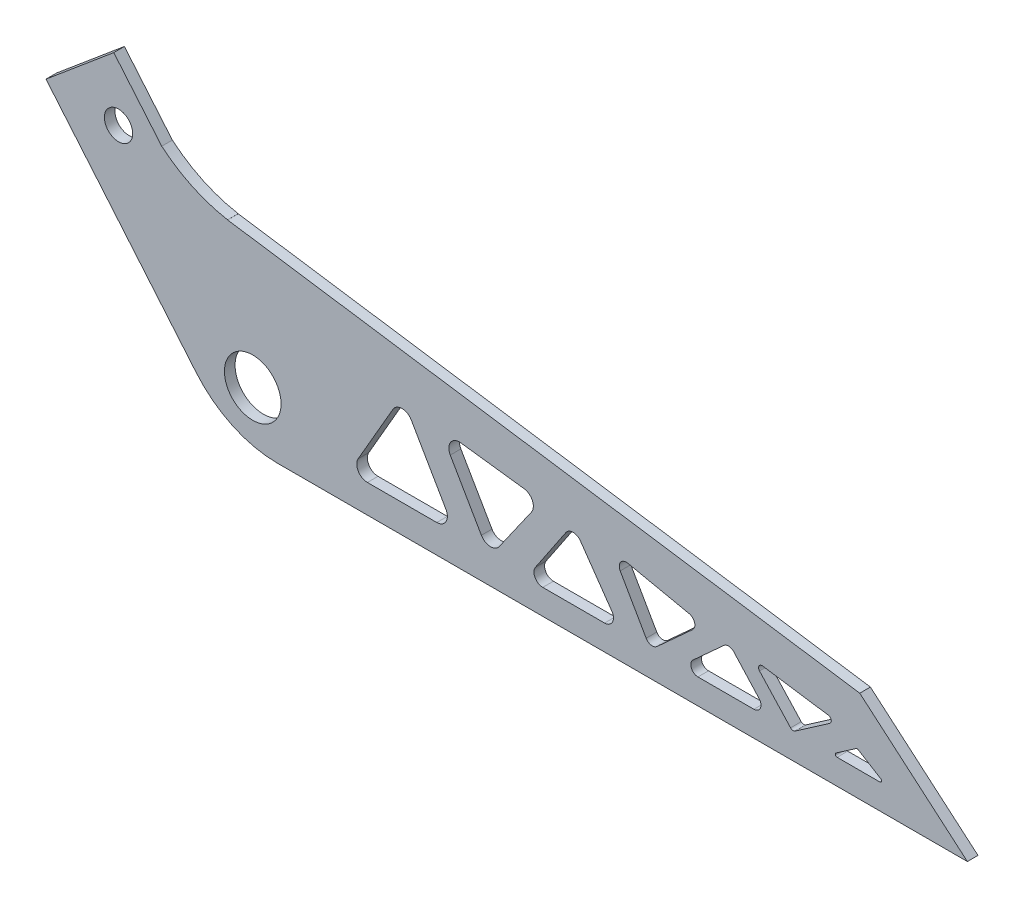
ISO-10303-21;
HEADER;
FILE_DESCRIPTION(('STEP AP214'),'2;1');
FILE_NAME('part.step','',(''),(''),'','','');
FILE_SCHEMA(('AUTOMOTIVE_DESIGN { 1 0 10303 214 1 1 1 1 }'));
ENDSEC;
DATA;
#1=APPLICATION_CONTEXT('core data for automotive mechanical design processes');
#2=APPLICATION_PROTOCOL_DEFINITION('international standard','automotive_design',2000,#1);
#3=PRODUCT_CONTEXT('',#1,'mechanical');
#4=PRODUCT('Part','Part','',(#3));
#5=PRODUCT_RELATED_PRODUCT_CATEGORY('part','',(#4));
#6=PRODUCT_DEFINITION_FORMATION('','',#4);
#7=PRODUCT_DEFINITION_CONTEXT('part definition',#1,'design');
#8=PRODUCT_DEFINITION('design','',#6,#7);
#9=PRODUCT_DEFINITION_SHAPE('','',#8);
#10=(LENGTH_UNIT() NAMED_UNIT(*) SI_UNIT(.MILLI.,.METRE.));
#11=(NAMED_UNIT(*) PLANE_ANGLE_UNIT() SI_UNIT($,.RADIAN.));
#12=(NAMED_UNIT(*) SI_UNIT($,.STERADIAN.) SOLID_ANGLE_UNIT());
#13=UNCERTAINTY_MEASURE_WITH_UNIT(LENGTH_MEASURE(1.E-05),#10,'distance_accuracy_value','');
#14=(GEOMETRIC_REPRESENTATION_CONTEXT(3) GLOBAL_UNCERTAINTY_ASSIGNED_CONTEXT((#13)) GLOBAL_UNIT_ASSIGNED_CONTEXT((#10,
#11,#12)) REPRESENTATION_CONTEXT('',''));
#15=CARTESIAN_POINT('',(0.,0.,0.));
#16=DIRECTION('',(0.,0.,1.));
#17=DIRECTION('',(1.,0.,0.));
#18=AXIS2_PLACEMENT_3D('',#15,#16,#17);
#19=CARTESIAN_POINT('',(51.2582606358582,-9.03821433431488,3.));
#20=DIRECTION('',(-0.984807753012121,0.173648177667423,0.));
#21=DIRECTION('',(-0.173648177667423,-0.984807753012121,0.));
#22=AXIS2_PLACEMENT_3D('',#19,#20,#21);
#23=PLANE('',#22);
#24=DIRECTION('',(0.173648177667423,0.984807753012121,0.));
#25=VECTOR('',#24,1.);
#26=CARTESIAN_POINT('',(51.2582606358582,-9.03821433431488,0.));
#27=LINE('',#26,#25);
#28=CARTESIAN_POINT('',(51.3013872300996,-8.79363126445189,0.));
#29=VERTEX_POINT('',#28);
#30=CARTESIAN_POINT('',(51.3050338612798,-8.77295019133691,0.));
#31=VERTEX_POINT('',#30);
#32=EDGE_CURVE('E526',#29,#31,#27,.T.);
#33=ORIENTED_EDGE('',*,*,#32,.T.);
#34=DIRECTION('',(0.,0.,-1.));
#35=VECTOR('',#34,1.);
#36=CARTESIAN_POINT('',(51.3050338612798,-8.77295019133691,3.));
#37=LINE('',#36,#35);
#38=CARTESIAN_POINT('',(51.3050338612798,-8.77295019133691,3.));
#39=VERTEX_POINT('',#38);
#40=EDGE_CURVE('E11',#39,#31,#37,.T.);
#41=ORIENTED_EDGE('',*,*,#40,.F.);
#42=DIRECTION('',(0.173648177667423,0.984807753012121,0.));
#43=VECTOR('',#42,1.);
#44=CARTESIAN_POINT('',(51.2582606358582,-9.03821433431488,3.));
#45=LINE('',#44,#43);
#46=CARTESIAN_POINT('',(51.3013872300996,-8.79363126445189,3.));
#47=VERTEX_POINT('',#46);
#48=EDGE_CURVE('E1220',#47,#39,#45,.T.);
#49=ORIENTED_EDGE('',*,*,#48,.F.);
#50=DIRECTION('',(0.,0.,-1.));
#51=VECTOR('',#50,1.);
#52=CARTESIAN_POINT('',(51.3013872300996,-8.79363126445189,3.));
#53=LINE('',#52,#51);
#54=EDGE_CURVE('E54',#47,#29,#53,.T.);
#55=ORIENTED_EDGE('',*,*,#54,.T.);
#56=EDGE_LOOP('',(#33,#41,#49,#55));
#57=FACE_BOUND('',#56,.T.);
#58=ADVANCED_FACE('F35',(#57),#23,.F.);
#59=CARTESIAN_POINT('',(58.1722937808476,30.1732161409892,3.));
#60=DIRECTION('',(0.,0.,-1.));
#61=DIRECTION('',(-1.,0.,0.));
#62=AXIS2_PLACEMENT_3D('',#59,#60,#61);
#63=CYLINDRICAL_SURFACE('',#62,39.5469737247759);
#64=CARTESIAN_POINT('',(58.1722937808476,30.1732161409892,0.));
#65=DIRECTION('',(0.,0.,1.));
#66=DIRECTION('',(1.,0.,0.));
#67=AXIS2_PLACEMENT_3D('',#64,#65,#66);
#68=CIRCLE('',#67,39.5469737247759);
#69=CARTESIAN_POINT('',(32.701647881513,-0.0792106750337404,0.));
#70=VERTEX_POINT('',#69);
#71=EDGE_CURVE('E528',#31,#70,#68,.F.);
#72=ORIENTED_EDGE('',*,*,#71,.T.);
#73=DIRECTION('',(0.,0.,-1.));
#74=VECTOR('',#73,1.);
#75=CARTESIAN_POINT('',(32.701647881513,-0.0792106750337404,3.));
#76=LINE('',#75,#74);
#77=CARTESIAN_POINT('',(32.701647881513,-0.0792106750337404,3.));
#78=VERTEX_POINT('',#77);
#79=EDGE_CURVE('E45',#78,#70,#76,.T.);
#80=ORIENTED_EDGE('',*,*,#79,.F.);
#81=CARTESIAN_POINT('',(58.1722937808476,30.1732161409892,3.));
#82=DIRECTION('',(0.,0.,1.));
#83=DIRECTION('',(1.,0.,0.));
#84=AXIS2_PLACEMENT_3D('',#81,#82,#83);
#85=CIRCLE('',#84,39.5469737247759);
#86=EDGE_CURVE('E1214',#39,#78,#85,.F.);
#87=ORIENTED_EDGE('',*,*,#86,.F.);
#88=ORIENTED_EDGE('',*,*,#40,.T.);
#89=EDGE_LOOP('',(#72,#80,#87,#88));
#90=FACE_BOUND('',#89,.T.);
#91=ADVANCED_FACE('F682',(#90),#63,.F.);
#92=CARTESIAN_POINT('',(19.1511110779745,16.0696902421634,3.));
#93=DIRECTION('',(0.766044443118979,0.642787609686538,0.));
#94=DIRECTION('',(-0.642787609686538,0.766044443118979,0.));
#95=AXIS2_PLACEMENT_3D('',#92,#93,#94);
#96=PLANE('',#95);
#97=DIRECTION('',(0.642787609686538,-0.766044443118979,0.));
#98=VECTOR('',#97,1.);
#99=CARTESIAN_POINT('',(19.1511110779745,16.0696902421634,0.));
#100=LINE('',#99,#98);
#101=CARTESIAN_POINT('',(19.1511110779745,16.0696902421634,0.));
#102=VERTEX_POINT('',#101);
#103=EDGE_CURVE('E531',#102,#70,#100,.T.);
#104=ORIENTED_EDGE('',*,*,#103,.F.);
#105=DIRECTION('',(0.,0.,-1.));
#106=VECTOR('',#105,1.);
#107=CARTESIAN_POINT('',(19.1511110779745,16.0696902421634,3.));
#108=LINE('',#107,#106);
#109=CARTESIAN_POINT('',(19.1511110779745,16.0696902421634,3.));
#110=VERTEX_POINT('',#109);
#111=EDGE_CURVE('E558',#110,#102,#108,.T.);
#112=ORIENTED_EDGE('',*,*,#111,.F.);
#113=DIRECTION('',(0.642787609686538,-0.766044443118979,0.));
#114=VECTOR('',#113,1.);
#115=CARTESIAN_POINT('',(19.1511110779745,16.0696902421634,3.));
#116=LINE('',#115,#114);
#117=EDGE_CURVE('E1211',#110,#78,#116,.T.);
#118=ORIENTED_EDGE('',*,*,#117,.T.);
#119=ORIENTED_EDGE('',*,*,#79,.T.);
#120=EDGE_LOOP('',(#104,#112,#118,#119));
#121=FACE_BOUND('',#120,.T.);
#122=ADVANCED_FACE('F687',(#121),#96,.T.);
#123=CARTESIAN_POINT('',(0.,0.,3.));
#124=DIRECTION('',(-0.642787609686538,0.766044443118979,0.));
#125=DIRECTION('',(-0.766044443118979,-0.642787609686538,0.));
#126=AXIS2_PLACEMENT_3D('',#123,#124,#125);
#127=PLANE('',#126);
#128=DIRECTION('',(0.766044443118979,0.642787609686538,0.));
#129=VECTOR('',#128,1.);
#130=CARTESIAN_POINT('',(0.,0.,0.));
#131=LINE('',#130,#129);
#132=CARTESIAN_POINT('',(0.,0.,0.));
#133=VERTEX_POINT('',#132);
#134=EDGE_CURVE('E534',#133,#102,#131,.T.);
#135=ORIENTED_EDGE('',*,*,#134,.F.);
#136=DIRECTION('',(0.,0.,-1.));
#137=VECTOR('',#136,1.);
#138=CARTESIAN_POINT('',(0.,0.,3.));
#139=LINE('',#138,#137);
#140=CARTESIAN_POINT('',(0.,0.,3.));
#141=VERTEX_POINT('',#140);
#142=EDGE_CURVE('E556',#141,#133,#139,.T.);
#143=ORIENTED_EDGE('',*,*,#142,.F.);
#144=DIRECTION('',(0.766044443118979,0.642787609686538,0.));
#145=VECTOR('',#144,1.);
#146=CARTESIAN_POINT('',(0.,0.,3.));
#147=LINE('',#146,#145);
#148=EDGE_CURVE('E1209',#141,#110,#147,.T.);
#149=ORIENTED_EDGE('',*,*,#148,.T.);
#150=ORIENTED_EDGE('',*,*,#111,.T.);
#151=EDGE_LOOP('',(#135,#143,#149,#150));
#152=FACE_BOUND('',#151,.T.);
#153=ADVANCED_FACE('F1133',(#152),#127,.T.);
#154=CARTESIAN_POINT('',(0.,0.,3.));
#155=DIRECTION('',(0.766044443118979,0.642787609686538,0.));
#156=DIRECTION('',(-0.642787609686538,0.766044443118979,0.));
#157=AXIS2_PLACEMENT_3D('',#154,#155,#156);
#158=PLANE('',#157);
#159=DIRECTION('',(0.642787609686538,-0.766044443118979,0.));
#160=VECTOR('',#159,1.);
#161=CARTESIAN_POINT('',(0.,0.,0.));
#162=LINE('',#161,#160);
#163=CARTESIAN_POINT('',(42.4309052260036,-50.5671837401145,0.));
#164=VERTEX_POINT('',#163);
#165=EDGE_CURVE('E537',#133,#164,#162,.T.);
#166=ORIENTED_EDGE('',*,*,#165,.T.);
#167=DIRECTION('',(0.,0.,-1.));
#168=VECTOR('',#167,1.);
#169=CARTESIAN_POINT('',(42.4309052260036,-50.5671837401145,3.));
#170=LINE('',#169,#168);
#171=CARTESIAN_POINT('',(42.4309052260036,-50.5671837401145,3.));
#172=VERTEX_POINT('',#171);
#173=EDGE_CURVE('E554',#172,#164,#170,.T.);
#174=ORIENTED_EDGE('',*,*,#173,.F.);
#175=DIRECTION('',(0.642787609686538,-0.766044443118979,0.));
#176=VECTOR('',#175,1.);
#177=CARTESIAN_POINT('',(0.,0.,3.));
#178=LINE('',#177,#176);
#179=EDGE_CURVE('E1210',#141,#172,#178,.T.);
#180=ORIENTED_EDGE('',*,*,#179,.F.);
#181=ORIENTED_EDGE('',*,*,#142,.T.);
#182=EDGE_LOOP('',(#166,#174,#180,#181));
#183=FACE_BOUND('',#182,.T.);
#184=ADVANCED_FACE('F1124',(#183),#158,.F.);
#185=CARTESIAN_POINT('',(65.412238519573,-31.2835554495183,3.));
#186=DIRECTION('',(0.,0.,-1.));
#187=DIRECTION('',(-1.,0.,0.));
#188=AXIS2_PLACEMENT_3D('',#185,#186,#187);
#189=CYLINDRICAL_SURFACE('',#188,30.);
#190=CARTESIAN_POINT('',(65.412238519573,-31.2835554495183,0.));
#191=DIRECTION('',(0.,0.,1.));
#192=DIRECTION('',(1.,0.,0.));
#193=AXIS2_PLACEMENT_3D('',#190,#191,#192);
#194=CIRCLE('',#193,30.);
#195=CARTESIAN_POINT('',(65.4122385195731,-61.2835554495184,0.));
#196=VERTEX_POINT('',#195);
#197=EDGE_CURVE('E540',#196,#164,#194,.F.);
#198=ORIENTED_EDGE('',*,*,#197,.F.);
#199=DIRECTION('',(0.,0.,-1.));
#200=VECTOR('',#199,1.);
#201=CARTESIAN_POINT('',(65.4122385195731,-61.2835554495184,3.));
#202=LINE('',#201,#200);
#203=CARTESIAN_POINT('',(65.4122385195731,-61.2835554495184,3.));
#204=VERTEX_POINT('',#203);
#205=EDGE_CURVE('E386',#204,#196,#202,.T.);
#206=ORIENTED_EDGE('',*,*,#205,.F.);
#207=CARTESIAN_POINT('',(65.412238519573,-31.2835554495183,3.));
#208=DIRECTION('',(0.,0.,1.));
#209=DIRECTION('',(1.,0.,0.));
#210=AXIS2_PLACEMENT_3D('',#207,#208,#209);
#211=CIRCLE('',#210,30.);
#212=EDGE_CURVE('E376',#204,#172,#211,.F.);
#213=ORIENTED_EDGE('',*,*,#212,.T.);
#214=ORIENTED_EDGE('',*,*,#173,.T.);
#215=EDGE_LOOP('',(#198,#206,#213,#214));
#216=FACE_BOUND('',#215,.T.);
#217=ADVANCED_FACE('F1116',(#216),#189,.T.);
#218=CARTESIAN_POINT('',(0.,-61.2835554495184,3.));
#219=DIRECTION('',(0.,1.,0.));
#220=DIRECTION('',(0.,0.,1.));
#221=AXIS2_PLACEMENT_3D('',#218,#219,#220);
#222=PLANE('',#221);
#223=DIRECTION('',(1.,0.,0.));
#224=VECTOR('',#223,1.);
#225=CARTESIAN_POINT('',(0.,-61.2835554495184,0.));
#226=LINE('',#225,#224);
#227=CARTESIAN_POINT('',(260.323357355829,-61.2835554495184,0.));
#228=VERTEX_POINT('',#227);
#229=EDGE_CURVE('E383',#196,#228,#226,.T.);
#230=ORIENTED_EDGE('',*,*,#229,.T.);
#231=DIRECTION('',(0.,0.,-1.));
#232=VECTOR('',#231,1.);
#233=CARTESIAN_POINT('',(260.323357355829,-61.2835554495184,3.));
#234=LINE('',#233,#232);
#235=CARTESIAN_POINT('',(260.323357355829,-61.2835554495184,3.));
#236=VERTEX_POINT('',#235);
#237=EDGE_CURVE('E380',#236,#228,#234,.T.);
#238=ORIENTED_EDGE('',*,*,#237,.F.);
#239=DIRECTION('',(1.,0.,0.));
#240=VECTOR('',#239,1.);
#241=CARTESIAN_POINT('',(0.,-61.2835554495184,3.));
#242=LINE('',#241,#240);
#243=EDGE_CURVE('E368',#204,#236,#242,.T.);
#244=ORIENTED_EDGE('',*,*,#243,.F.);
#245=ORIENTED_EDGE('',*,*,#205,.T.);
#246=EDGE_LOOP('',(#230,#238,#244,#245));
#247=FACE_BOUND('',#246,.T.);
#248=ADVANCED_FACE('F381',(#247),#222,.F.);
#249=CARTESIAN_POINT('',(79.6538069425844,93.1723411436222,3.));
#250=DIRECTION('',(-0.649811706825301,-0.760095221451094,0.));
#251=DIRECTION('',(0.760095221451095,-0.649811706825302,0.));
#252=AXIS2_PLACEMENT_3D('',#249,#250,#251);
#253=PLANE('',#252);
#254=DIRECTION('',(-0.760095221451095,0.649811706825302,0.));
#255=VECTOR('',#254,1.);
#256=CARTESIAN_POINT('',(79.6538069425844,93.1723411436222,0.));
#257=LINE('',#256,#255);
#258=CARTESIAN_POINT('',(229.919548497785,-35.2910871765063,0.));
#259=VERTEX_POINT('',#258);
#260=EDGE_CURVE('E544',#228,#259,#257,.T.);
#261=ORIENTED_EDGE('',*,*,#260,.T.);
#262=DIRECTION('',(0.,0.,-1.));
#263=VECTOR('',#262,1.);
#264=CARTESIAN_POINT('',(229.919548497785,-35.2910871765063,3.));
#265=LINE('',#264,#263);
#266=CARTESIAN_POINT('',(229.919548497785,-35.2910871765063,3.));
#267=VERTEX_POINT('',#266);
#268=EDGE_CURVE('E210',#267,#259,#265,.T.);
#269=ORIENTED_EDGE('',*,*,#268,.F.);
#270=DIRECTION('',(-0.760095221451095,0.649811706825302,0.));
#271=VECTOR('',#270,1.);
#272=CARTESIAN_POINT('',(79.6538069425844,93.1723411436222,3.));
#273=LINE('',#272,#271);
#274=EDGE_CURVE('E374',#236,#267,#273,.T.);
#275=ORIENTED_EDGE('',*,*,#274,.F.);
#276=ORIENTED_EDGE('',*,*,#237,.T.);
#277=EDGE_LOOP('',(#261,#269,#275,#276));
#278=FACE_BOUND('',#277,.T.);
#279=ADVANCED_FACE('F388',(#278),#253,.F.);
#280=CARTESIAN_POINT('',(229.176126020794,-49.7540161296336,3.));
#281=DIRECTION('',(0.,0.,-1.));
#282=DIRECTION('',(-1.,0.,0.));
#283=AXIS2_PLACEMENT_3D('',#280,#281,#282);
#284=CYLINDRICAL_SURFACE('',#283,0.500000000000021);
#285=CARTESIAN_POINT('',(229.176126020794,-49.7540161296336,0.));
#286=DIRECTION('',(0.,0.,1.));
#287=DIRECTION('',(1.,0.,0.));
#288=AXIS2_PLACEMENT_3D('',#285,#286,#287);
#289=CIRCLE('',#288,0.500000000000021);
#290=CARTESIAN_POINT('',(229.437062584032,-49.3275045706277,0.));
#291=VERTEX_POINT('',#290);
#292=CARTESIAN_POINT('',(228.891360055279,-49.3430315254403,0.));
#293=VERTEX_POINT('',#292);
#294=EDGE_CURVE('E508',#291,#293,#289,.T.);
#295=ORIENTED_EDGE('',*,*,#294,.F.);
#296=DIRECTION('',(0.,0.,-1.));
#297=VECTOR('',#296,1.);
#298=CARTESIAN_POINT('',(229.437062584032,-49.3275045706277,3.));
#299=LINE('',#298,#297);
#300=CARTESIAN_POINT('',(229.437062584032,-49.3275045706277,3.));
#301=VERTEX_POINT('',#300);
#302=EDGE_CURVE('E551',#301,#291,#299,.T.);
#303=ORIENTED_EDGE('',*,*,#302,.F.);
#304=CARTESIAN_POINT('',(229.176126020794,-49.7540161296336,3.));
#305=DIRECTION('',(0.,0.,1.));
#306=DIRECTION('',(1.,0.,0.));
#307=AXIS2_PLACEMENT_3D('',#304,#305,#306);
#308=CIRCLE('',#307,0.500000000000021);
#309=CARTESIAN_POINT('',(228.891360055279,-49.3430315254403,3.));
#310=VERTEX_POINT('',#309);
#311=EDGE_CURVE('E1236',#301,#310,#308,.T.);
#312=ORIENTED_EDGE('',*,*,#311,.T.);
#313=DIRECTION('',(0.,0.,-1.));
#314=VECTOR('',#313,1.);
#315=CARTESIAN_POINT('',(228.891360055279,-49.3430315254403,3.));
#316=LINE('',#315,#314);
#317=EDGE_CURVE('E561',#310,#293,#316,.T.);
#318=ORIENTED_EDGE('',*,*,#317,.T.);
#319=EDGE_LOOP('',(#295,#303,#312,#318));
#320=FACE_BOUND('',#319,.T.);
#321=ADVANCED_FACE('F713',(#320),#284,.F.);
#322=CARTESIAN_POINT('',(40.5284245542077,66.2453790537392,3.));
#323=DIRECTION('',(0.521873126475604,0.853023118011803,0.));
#324=DIRECTION('',(-0.853023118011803,0.521873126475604,0.));
#325=AXIS2_PLACEMENT_3D('',#322,#323,#324);
#326=PLANE('',#325);
#327=DIRECTION('',(0.853023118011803,-0.521873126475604,0.));
#328=VECTOR('',#327,1.);
#329=CARTESIAN_POINT('',(40.5284245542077,66.2453790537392,0.));
#330=LINE('',#329,#328);
#331=CARTESIAN_POINT('',(235.85201708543,-53.2521254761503,0.));
#332=VERTEX_POINT('',#331);
#333=EDGE_CURVE('E511',#291,#332,#330,.T.);
#334=ORIENTED_EDGE('',*,*,#333,.T.);
#335=DIRECTION('',(0.,0.,-1.));
#336=VECTOR('',#335,1.);
#337=CARTESIAN_POINT('',(235.85201708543,-53.2521254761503,3.));
#338=LINE('',#337,#336);
#339=CARTESIAN_POINT('',(235.85201708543,-53.2521254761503,3.));
#340=VERTEX_POINT('',#339);
#341=EDGE_CURVE('E572',#340,#332,#338,.T.);
#342=ORIENTED_EDGE('',*,*,#341,.F.);
#343=DIRECTION('',(0.853023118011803,-0.521873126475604,0.));
#344=VECTOR('',#343,1.);
#345=CARTESIAN_POINT('',(40.5284245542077,66.2453790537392,3.));
#346=LINE('',#345,#344);
#347=EDGE_CURVE('E1234',#301,#340,#346,.T.);
#348=ORIENTED_EDGE('',*,*,#347,.F.);
#349=ORIENTED_EDGE('',*,*,#302,.T.);
#350=EDGE_LOOP('',(#334,#342,#348,#349));
#351=FACE_BOUND('',#350,.T.);
#352=ADVANCED_FACE('F709',(#351),#326,.F.);
#353=CARTESIAN_POINT('',(235.591080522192,-53.6786370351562,3.));
#354=DIRECTION('',(0.,0.,-1.));
#355=DIRECTION('',(-1.,0.,0.));
#356=AXIS2_PLACEMENT_3D('',#353,#354,#355);
#357=CYLINDRICAL_SURFACE('',#356,0.500000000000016);
#358=CARTESIAN_POINT('',(235.591080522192,-53.6786370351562,0.));
#359=DIRECTION('',(0.,0.,1.));
#360=DIRECTION('',(1.,0.,0.));
#361=AXIS2_PLACEMENT_3D('',#358,#359,#360);
#362=CIRCLE('',#361,0.500000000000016);
#363=CARTESIAN_POINT('',(235.591080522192,-54.1786370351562,0.));
#364=VERTEX_POINT('',#363);
#365=EDGE_CURVE('E514',#364,#332,#362,.T.);
#366=ORIENTED_EDGE('',*,*,#365,.F.);
#367=DIRECTION('',(0.,0.,-1.));
#368=VECTOR('',#367,1.);
#369=CARTESIAN_POINT('',(235.591080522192,-54.1786370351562,3.));
#370=LINE('',#369,#368);
#371=CARTESIAN_POINT('',(235.591080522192,-54.1786370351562,3.));
#372=VERTEX_POINT('',#371);
#373=EDGE_CURVE('E570',#372,#364,#370,.T.);
#374=ORIENTED_EDGE('',*,*,#373,.F.);
#375=CARTESIAN_POINT('',(235.591080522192,-53.6786370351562,3.));
#376=DIRECTION('',(0.,0.,1.));
#377=DIRECTION('',(1.,0.,0.));
#378=AXIS2_PLACEMENT_3D('',#375,#376,#377);
#379=CIRCLE('',#378,0.500000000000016);
#380=EDGE_CURVE('E1231',#372,#340,#379,.T.);
#381=ORIENTED_EDGE('',*,*,#380,.T.);
#382=ORIENTED_EDGE('',*,*,#341,.T.);
#383=EDGE_LOOP('',(#366,#374,#381,#382));
#384=FACE_BOUND('',#383,.T.);
#385=ADVANCED_FACE('F705',(#384),#357,.F.);
#386=CARTESIAN_POINT('',(-1.24492552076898E-13,-54.1786370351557,3.));
#387=DIRECTION('',(0.,-1.,0.));
#388=DIRECTION('',(1.,0.,0.));
#389=AXIS2_PLACEMENT_3D('',#386,#387,#388);
#390=PLANE('',#389);
#391=DIRECTION('',(-1.,0.,0.));
#392=VECTOR('',#391,1.);
#393=CARTESIAN_POINT('',(-1.24492552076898E-13,-54.1786370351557,0.));
#394=LINE('',#393,#392);
#395=CARTESIAN_POINT('',(223.511970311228,-54.1786370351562,0.));
#396=VERTEX_POINT('',#395);
#397=EDGE_CURVE('E517',#364,#396,#394,.T.);
#398=ORIENTED_EDGE('',*,*,#397,.T.);
#399=DIRECTION('',(0.,0.,-1.));
#400=VECTOR('',#399,1.);
#401=CARTESIAN_POINT('',(223.511970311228,-54.1786370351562,3.));
#402=LINE('',#401,#400);
#403=CARTESIAN_POINT('',(223.511970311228,-54.1786370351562,3.));
#404=VERTEX_POINT('',#403);
#405=EDGE_CURVE('E567',#404,#396,#402,.T.);
#406=ORIENTED_EDGE('',*,*,#405,.F.);
#407=DIRECTION('',(-1.,0.,0.));
#408=VECTOR('',#407,1.);
#409=CARTESIAN_POINT('',(-1.24492552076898E-13,-54.1786370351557,3.));
#410=LINE('',#409,#408);
#411=EDGE_CURVE('E1228',#372,#404,#410,.T.);
#412=ORIENTED_EDGE('',*,*,#411,.F.);
#413=ORIENTED_EDGE('',*,*,#373,.T.);
#414=EDGE_LOOP('',(#398,#406,#412,#413));
#415=FACE_BOUND('',#414,.T.);
#416=ADVANCED_FACE('F701',(#415),#390,.F.);
#417=CARTESIAN_POINT('',(223.511970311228,-53.6786370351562,3.));
#418=DIRECTION('',(0.,0.,-1.));
#419=DIRECTION('',(-1.,0.,0.));
#420=AXIS2_PLACEMENT_3D('',#417,#418,#419);
#421=CYLINDRICAL_SURFACE('',#420,0.500000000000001);
#422=CARTESIAN_POINT('',(223.511970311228,-53.6786370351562,0.));
#423=DIRECTION('',(0.,0.,1.));
#424=DIRECTION('',(1.,0.,0.));
#425=AXIS2_PLACEMENT_3D('',#422,#423,#424);
#426=CIRCLE('',#425,0.500000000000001);
#427=CARTESIAN_POINT('',(223.227204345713,-53.2676524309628,0.));
#428=VERTEX_POINT('',#427);
#429=EDGE_CURVE('E520',#396,#428,#426,.F.);
#430=ORIENTED_EDGE('',*,*,#429,.T.);
#431=DIRECTION('',(0.,0.,-1.));
#432=VECTOR('',#431,1.);
#433=CARTESIAN_POINT('',(223.227204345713,-53.2676524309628,3.));
#434=LINE('',#433,#432);
#435=CARTESIAN_POINT('',(223.227204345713,-53.2676524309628,3.));
#436=VERTEX_POINT('',#435);
#437=EDGE_CURVE('E563',#436,#428,#434,.T.);
#438=ORIENTED_EDGE('',*,*,#437,.F.);
#439=CARTESIAN_POINT('',(223.511970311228,-53.6786370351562,3.));
#440=DIRECTION('',(0.,0.,1.));
#441=DIRECTION('',(1.,0.,0.));
#442=AXIS2_PLACEMENT_3D('',#439,#440,#441);
#443=CIRCLE('',#442,0.500000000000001);
#444=EDGE_CURVE('E1223',#404,#436,#443,.F.);
#445=ORIENTED_EDGE('',*,*,#444,.F.);
#446=ORIENTED_EDGE('',*,*,#405,.T.);
#447=EDGE_LOOP('',(#430,#438,#445,#446));
#448=FACE_BOUND('',#447,.T.);
#449=ADVANCED_FACE('F697',(#448),#421,.F.);
#450=CARTESIAN_POINT('',(192.840440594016,-44.3046674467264,3.));
#451=DIRECTION('',(0.,0.,-1.));
#452=DIRECTION('',(-1.,0.,0.));
#453=AXIS2_PLACEMENT_3D('',#450,#451,#452);
#454=CYLINDRICAL_SURFACE('',#453,2.);
#455=CARTESIAN_POINT('',(192.840440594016,-44.3046674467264,0.));
#456=DIRECTION('',(0.,0.,1.));
#457=DIRECTION('',(1.,0.,0.));
#458=AXIS2_PLACEMENT_3D('',#455,#456,#457);
#459=CIRCLE('',#458,2.);
#460=CARTESIAN_POINT('',(194.319523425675,-42.9584453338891,0.));
#461=VERTEX_POINT('',#460);
#462=CARTESIAN_POINT('',(191.494218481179,-42.8255846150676,0.));
#463=VERTEX_POINT('',#462);
#464=EDGE_CURVE('E490',#461,#463,#459,.T.);
#465=ORIENTED_EDGE('',*,*,#464,.F.);
#466=DIRECTION('',(0.,0.,-1.));
#467=VECTOR('',#466,1.);
#468=CARTESIAN_POINT('',(194.319523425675,-42.9584453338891,3.));
#469=LINE('',#468,#467);
#470=CARTESIAN_POINT('',(194.319523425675,-42.9584453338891,3.));
#471=VERTEX_POINT('',#470);
#472=EDGE_CURVE('E564',#471,#461,#469,.T.);
#473=ORIENTED_EDGE('',*,*,#472,.F.);
#474=CARTESIAN_POINT('',(192.840440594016,-44.3046674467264,3.));
#475=DIRECTION('',(0.,0.,1.));
#476=DIRECTION('',(1.,0.,0.));
#477=AXIS2_PLACEMENT_3D('',#474,#475,#476);
#478=CIRCLE('',#477,2.);
#479=CARTESIAN_POINT('',(191.494218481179,-42.8255846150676,3.));
#480=VERTEX_POINT('',#479);
#481=EDGE_CURVE('E1253',#471,#480,#478,.T.);
#482=ORIENTED_EDGE('',*,*,#481,.T.);
#483=DIRECTION('',(0.,0.,-1.));
#484=VECTOR('',#483,1.);
#485=CARTESIAN_POINT('',(191.494218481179,-42.8255846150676,3.));
#486=LINE('',#485,#484);
#487=EDGE_CURVE('E575',#480,#463,#486,.T.);
#488=ORIENTED_EDGE('',*,*,#487,.T.);
#489=EDGE_LOOP('',(#465,#473,#482,#488));
#490=FACE_BOUND('',#489,.T.);
#491=ADVANCED_FACE('F700',(#490),#454,.F.);
#492=CARTESIAN_POINT('',(84.8930913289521,77.2674486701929,3.));
#493=DIRECTION('',(-0.739541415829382,-0.673111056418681,0.));
#494=DIRECTION('',(0.673111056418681,-0.739541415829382,0.));
#495=AXIS2_PLACEMENT_3D('',#492,#493,#494);
#496=PLANE('',#495);
#497=DIRECTION('',(-0.673111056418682,0.739541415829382,0.));
#498=VECTOR('',#497,1.);
#499=CARTESIAN_POINT('',(84.8930913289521,77.2674486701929,0.));
#500=LINE('',#499,#498);
#501=CARTESIAN_POINT('',(201.486202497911,-50.8324149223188,0.));
#502=VERTEX_POINT('',#501);
#503=EDGE_CURVE('E493',#502,#461,#500,.T.);
#504=ORIENTED_EDGE('',*,*,#503,.F.);
#505=DIRECTION('',(0.,0.,-1.));
#506=VECTOR('',#505,1.);
#507=CARTESIAN_POINT('',(201.486202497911,-50.8324149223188,3.));
#508=LINE('',#507,#506);
#509=CARTESIAN_POINT('',(201.486202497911,-50.8324149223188,3.));
#510=VERTEX_POINT('',#509);
#511=EDGE_CURVE('E584',#510,#502,#508,.T.);
#512=ORIENTED_EDGE('',*,*,#511,.F.);
#513=DIRECTION('',(-0.673111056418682,0.739541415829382,0.));
#514=VECTOR('',#513,1.);
#515=CARTESIAN_POINT('',(84.8930913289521,77.2674486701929,3.));
#516=LINE('',#515,#514);
#517=EDGE_CURVE('E1250',#510,#471,#516,.T.);
#518=ORIENTED_EDGE('',*,*,#517,.T.);
#519=ORIENTED_EDGE('',*,*,#472,.T.);
#520=EDGE_LOOP('',(#504,#512,#518,#519));
#521=FACE_BOUND('',#520,.T.);
#522=ADVANCED_FACE('F734',(#521),#496,.T.);
#523=CARTESIAN_POINT('',(200.007119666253,-52.1786370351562,3.));
#524=DIRECTION('',(0.,0.,-1.));
#525=DIRECTION('',(-1.,0.,0.));
#526=AXIS2_PLACEMENT_3D('',#523,#524,#525);
#527=CYLINDRICAL_SURFACE('',#526,2.);
#528=CARTESIAN_POINT('',(200.007119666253,-52.1786370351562,0.));
#529=DIRECTION('',(0.,0.,1.));
#530=DIRECTION('',(1.,0.,0.));
#531=AXIS2_PLACEMENT_3D('',#528,#529,#530);
#532=CIRCLE('',#531,2.);
#533=CARTESIAN_POINT('',(200.007119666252,-54.1786370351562,0.));
#534=VERTEX_POINT('',#533);
#535=EDGE_CURVE('E496',#534,#502,#532,.T.);
#536=ORIENTED_EDGE('',*,*,#535,.F.);
#537=DIRECTION('',(0.,0.,-1.));
#538=VECTOR('',#537,1.);
#539=CARTESIAN_POINT('',(200.007119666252,-54.1786370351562,3.));
#540=LINE('',#539,#538);
#541=CARTESIAN_POINT('',(200.007119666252,-54.1786370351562,3.));
#542=VERTEX_POINT('',#541);
#543=EDGE_CURVE('E582',#542,#534,#540,.T.);
#544=ORIENTED_EDGE('',*,*,#543,.F.);
#545=CARTESIAN_POINT('',(200.007119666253,-52.1786370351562,3.));
#546=DIRECTION('',(0.,0.,1.));
#547=DIRECTION('',(1.,0.,0.));
#548=AXIS2_PLACEMENT_3D('',#545,#546,#547);
#549=CIRCLE('',#548,2.);
#550=EDGE_CURVE('E1247',#542,#510,#549,.T.);
#551=ORIENTED_EDGE('',*,*,#550,.T.);
#552=ORIENTED_EDGE('',*,*,#511,.T.);
#553=EDGE_LOOP('',(#536,#544,#551,#552));
#554=FACE_BOUND('',#553,.T.);
#555=ADVANCED_FACE('F730',(#554),#527,.F.);
#556=CARTESIAN_POINT('',(0.,-54.1786370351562,3.));
#557=DIRECTION('',(0.,1.,0.));
#558=DIRECTION('',(0.,0.,1.));
#559=AXIS2_PLACEMENT_3D('',#556,#557,#558);
#560=PLANE('',#559);
#561=DIRECTION('',(1.,0.,0.));
#562=VECTOR('',#561,1.);
#563=CARTESIAN_POINT('',(0.,-54.1786370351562,0.));
#564=LINE('',#563,#562);
#565=CARTESIAN_POINT('',(184.189376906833,-54.1786370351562,0.));
#566=VERTEX_POINT('',#565);
#567=EDGE_CURVE('E499',#566,#534,#564,.T.);
#568=ORIENTED_EDGE('',*,*,#567,.F.);
#569=DIRECTION('',(0.,0.,-1.));
#570=VECTOR('',#569,1.);
#571=CARTESIAN_POINT('',(184.189376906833,-54.1786370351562,3.));
#572=LINE('',#571,#570);
#573=CARTESIAN_POINT('',(184.189376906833,-54.1786370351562,3.));
#574=VERTEX_POINT('',#573);
#575=EDGE_CURVE('E580',#574,#566,#572,.T.);
#576=ORIENTED_EDGE('',*,*,#575,.F.);
#577=DIRECTION('',(1.,0.,0.));
#578=VECTOR('',#577,1.);
#579=CARTESIAN_POINT('',(0.,-54.1786370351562,3.));
#580=LINE('',#579,#578);
#581=EDGE_CURVE('E1244',#574,#542,#580,.T.);
#582=ORIENTED_EDGE('',*,*,#581,.T.);
#583=ORIENTED_EDGE('',*,*,#543,.T.);
#584=EDGE_LOOP('',(#568,#576,#582,#583));
#585=FACE_BOUND('',#584,.T.);
#586=ADVANCED_FACE('F726',(#585),#560,.T.);
#587=CARTESIAN_POINT('',(184.189376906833,-52.1786370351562,3.));
#588=DIRECTION('',(0.,0.,-1.));
#589=DIRECTION('',(-1.,0.,0.));
#590=AXIS2_PLACEMENT_3D('',#587,#588,#589);
#591=CYLINDRICAL_SURFACE('',#590,2.);
#592=CARTESIAN_POINT('',(184.189376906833,-52.1786370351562,0.));
#593=DIRECTION('',(0.,0.,1.));
#594=DIRECTION('',(1.,0.,0.));
#595=AXIS2_PLACEMENT_3D('',#592,#593,#594);
#596=CIRCLE('',#595,2.);
#597=CARTESIAN_POINT('',(182.843154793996,-50.6995542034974,0.));
#598=VERTEX_POINT('',#597);
#599=EDGE_CURVE('E502',#566,#598,#596,.F.);
#600=ORIENTED_EDGE('',*,*,#599,.T.);
#601=DIRECTION('',(0.,0.,-1.));
#602=VECTOR('',#601,1.);
#603=CARTESIAN_POINT('',(182.843154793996,-50.6995542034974,3.));
#604=LINE('',#603,#602);
#605=CARTESIAN_POINT('',(182.843154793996,-50.6995542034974,3.));
#606=VERTEX_POINT('',#605);
#607=EDGE_CURVE('E577',#606,#598,#604,.T.);
#608=ORIENTED_EDGE('',*,*,#607,.F.);
#609=CARTESIAN_POINT('',(184.189376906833,-52.1786370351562,3.));
#610=DIRECTION('',(0.,0.,1.));
#611=DIRECTION('',(1.,0.,0.));
#612=AXIS2_PLACEMENT_3D('',#609,#610,#611);
#613=CIRCLE('',#612,2.);
#614=EDGE_CURVE('E1242',#574,#606,#613,.F.);
#615=ORIENTED_EDGE('',*,*,#614,.F.);
#616=ORIENTED_EDGE('',*,*,#575,.T.);
#617=EDGE_LOOP('',(#600,#608,#615,#616));
#618=FACE_BOUND('',#617,.T.);
#619=ADVANCED_FACE('F722',(#618),#591,.F.);
#620=CARTESIAN_POINT('',(87.2763583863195,-50.389029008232,3.));
#621=DIRECTION('',(0.866025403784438,-0.500000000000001,0.));
#622=DIRECTION('',(0.500000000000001,0.866025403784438,0.));
#623=AXIS2_PLACEMENT_3D('',#620,#621,#622);
#624=PLANE('',#623);
#625=DIRECTION('',(-0.500000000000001,-0.866025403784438,0.));
#626=VECTOR('',#625,1.);
#627=CARTESIAN_POINT('',(87.2763583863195,-50.389029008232,0.));
#628=LINE('',#627,#626);
#629=CARTESIAN_POINT('',(98.0071265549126,-31.802793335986,0.));
#630=VERTEX_POINT('',#629);
#631=CARTESIAN_POINT('',(88.2032789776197,-48.7835554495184,0.));
#632=VERTEX_POINT('',#631);
#633=EDGE_CURVE('E469',#630,#632,#628,.T.);
#634=ORIENTED_EDGE('',*,*,#633,.F.);
#635=DIRECTION('',(0.,0.,-1.));
#636=VECTOR('',#635,1.);
#637=CARTESIAN_POINT('',(98.0071265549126,-31.802793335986,3.));
#638=LINE('',#637,#636);
#639=CARTESIAN_POINT('',(98.0071265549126,-31.802793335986,3.));
#640=VERTEX_POINT('',#639);
#641=EDGE_CURVE('E578',#640,#630,#638,.T.);
#642=ORIENTED_EDGE('',*,*,#641,.F.);
#643=DIRECTION('',(-0.500000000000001,-0.866025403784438,0.));
#644=VECTOR('',#643,1.);
#645=CARTESIAN_POINT('',(87.2763583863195,-50.389029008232,3.));
#646=LINE('',#645,#644);
#647=CARTESIAN_POINT('',(88.2032789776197,-48.7835554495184,3.));
#648=VERTEX_POINT('',#647);
#649=EDGE_CURVE('E1272',#640,#648,#646,.T.);
#650=ORIENTED_EDGE('',*,*,#649,.T.);
#651=DIRECTION('',(0.,0.,-1.));
#652=VECTOR('',#651,1.);
#653=CARTESIAN_POINT('',(88.2032789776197,-48.7835554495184,3.));
#654=LINE('',#653,#652);
#655=EDGE_CURVE('E587',#648,#632,#654,.T.);
#656=ORIENTED_EDGE('',*,*,#655,.T.);
#657=EDGE_LOOP('',(#634,#642,#650,#656));
#658=FACE_BOUND('',#657,.T.);
#659=ADVANCED_FACE('F725',(#658),#624,.T.);
#660=CARTESIAN_POINT('',(100.605202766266,-33.302793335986,3.));
#661=DIRECTION('',(0.,0.,-1.));
#662=DIRECTION('',(-1.,0.,0.));
#663=AXIS2_PLACEMENT_3D('',#660,#661,#662);
#664=CYLINDRICAL_SURFACE('',#663,2.99999999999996);
#665=CARTESIAN_POINT('',(100.605202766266,-33.302793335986,0.));
#666=DIRECTION('',(0.,0.,1.));
#667=DIRECTION('',(1.,0.,0.));
#668=AXIS2_PLACEMENT_3D('',#665,#666,#667);
#669=CIRCLE('',#668,2.99999999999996);
#670=CARTESIAN_POINT('',(103.203278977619,-31.802793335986,0.));
#671=VERTEX_POINT('',#670);
#672=EDGE_CURVE('E472',#630,#671,#669,.F.);
#673=ORIENTED_EDGE('',*,*,#672,.T.);
#674=DIRECTION('',(0.,0.,-1.));
#675=VECTOR('',#674,1.);
#676=CARTESIAN_POINT('',(103.203278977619,-31.802793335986,3.));
#677=LINE('',#676,#675);
#678=CARTESIAN_POINT('',(103.203278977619,-31.802793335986,3.));
#679=VERTEX_POINT('',#678);
#680=EDGE_CURVE('E596',#679,#671,#677,.T.);
#681=ORIENTED_EDGE('',*,*,#680,.F.);
#682=CARTESIAN_POINT('',(100.605202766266,-33.302793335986,3.));
#683=DIRECTION('',(0.,0.,1.));
#684=DIRECTION('',(1.,0.,0.));
#685=AXIS2_PLACEMENT_3D('',#682,#683,#684);
#686=CIRCLE('',#685,2.99999999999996);
#687=EDGE_CURVE('E1270',#640,#679,#686,.F.);
#688=ORIENTED_EDGE('',*,*,#687,.F.);
#689=ORIENTED_EDGE('',*,*,#641,.T.);
#690=EDGE_LOOP('',(#673,#681,#688,#689));
#691=FACE_BOUND('',#690,.T.);
#692=ADVANCED_FACE('F762',(#691),#664,.F.);
#693=CARTESIAN_POINT('',(63.6314457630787,36.737632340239,3.));
#694=DIRECTION('',(-0.866025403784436,-0.500000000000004,0.));
#695=DIRECTION('',(0.500000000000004,-0.866025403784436,0.));
#696=AXIS2_PLACEMENT_3D('',#693,#694,#695);
#697=PLANE('',#696);
#698=DIRECTION('',(-0.500000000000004,0.866025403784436,0.));
#699=VECTOR('',#698,1.);
#700=CARTESIAN_POINT('',(63.6314457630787,36.737632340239,0.));
#701=LINE('',#700,#699);
#702=CARTESIAN_POINT('',(113.007126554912,-48.7835554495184,0.));
#703=VERTEX_POINT('',#702);
#704=EDGE_CURVE('E475',#703,#671,#701,.T.);
#705=ORIENTED_EDGE('',*,*,#704,.F.);
#706=DIRECTION('',(0.,0.,-1.));
#707=VECTOR('',#706,1.);
#708=CARTESIAN_POINT('',(113.007126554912,-48.7835554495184,3.));
#709=LINE('',#708,#707);
#710=CARTESIAN_POINT('',(113.007126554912,-48.7835554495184,3.));
#711=VERTEX_POINT('',#710);
#712=EDGE_CURVE('E594',#711,#703,#709,.T.);
#713=ORIENTED_EDGE('',*,*,#712,.F.);
#714=DIRECTION('',(-0.500000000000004,0.866025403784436,0.));
#715=VECTOR('',#714,1.);
#716=CARTESIAN_POINT('',(63.6314457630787,36.737632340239,3.));
#717=LINE('',#716,#715);
#718=EDGE_CURVE('E1267',#711,#679,#717,.T.);
#719=ORIENTED_EDGE('',*,*,#718,.T.);
#720=ORIENTED_EDGE('',*,*,#680,.T.);
#721=EDGE_LOOP('',(#705,#713,#719,#720));
#722=FACE_BOUND('',#721,.T.);
#723=ADVANCED_FACE('F758',(#722),#697,.T.);
#724=CARTESIAN_POINT('',(110.409050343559,-50.2835554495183,3.));
#725=DIRECTION('',(0.,0.,-1.));
#726=DIRECTION('',(-1.,0.,0.));
#727=AXIS2_PLACEMENT_3D('',#724,#725,#726);
#728=CYLINDRICAL_SURFACE('',#727,3.00000000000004);
#729=CARTESIAN_POINT('',(110.409050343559,-50.2835554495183,0.));
#730=DIRECTION('',(0.,0.,1.));
#731=DIRECTION('',(1.,0.,0.));
#732=AXIS2_PLACEMENT_3D('',#729,#730,#731);
#733=CIRCLE('',#732,3.00000000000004);
#734=CARTESIAN_POINT('',(110.409050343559,-53.2835554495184,0.));
#735=VERTEX_POINT('',#734);
#736=EDGE_CURVE('E478',#735,#703,#733,.T.);
#737=ORIENTED_EDGE('',*,*,#736,.F.);
#738=DIRECTION('',(0.,0.,-1.));
#739=VECTOR('',#738,1.);
#740=CARTESIAN_POINT('',(110.409050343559,-53.2835554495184,3.));
#741=LINE('',#740,#739);
#742=CARTESIAN_POINT('',(110.409050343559,-53.2835554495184,3.));
#743=VERTEX_POINT('',#742);
#744=EDGE_CURVE('E592',#743,#735,#741,.T.);
#745=ORIENTED_EDGE('',*,*,#744,.F.);
#746=CARTESIAN_POINT('',(110.409050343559,-50.2835554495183,3.));
#747=DIRECTION('',(0.,0.,1.));
#748=DIRECTION('',(1.,0.,0.));
#749=AXIS2_PLACEMENT_3D('',#746,#747,#748);
#750=CIRCLE('',#749,3.00000000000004);
#751=EDGE_CURVE('E1264',#743,#711,#750,.T.);
#752=ORIENTED_EDGE('',*,*,#751,.T.);
#753=ORIENTED_EDGE('',*,*,#712,.T.);
#754=EDGE_LOOP('',(#737,#745,#752,#753));
#755=FACE_BOUND('',#754,.T.);
#756=ADVANCED_FACE('F754',(#755),#728,.F.);
#757=CARTESIAN_POINT('',(0.,-53.2835554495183,3.));
#758=DIRECTION('',(0.,1.,0.));
#759=DIRECTION('',(-1.,0.,0.));
#760=AXIS2_PLACEMENT_3D('',#757,#758,#759);
#761=PLANE('',#760);
#762=DIRECTION('',(1.,0.,0.));
#763=VECTOR('',#762,1.);
#764=CARTESIAN_POINT('',(0.,-53.2835554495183,0.));
#765=LINE('',#764,#763);
#766=CARTESIAN_POINT('',(90.801355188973,-53.2835554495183,0.));
#767=VERTEX_POINT('',#766);
#768=EDGE_CURVE('E481',#767,#735,#765,.T.);
#769=ORIENTED_EDGE('',*,*,#768,.F.);
#770=DIRECTION('',(0.,0.,-1.));
#771=VECTOR('',#770,1.);
#772=CARTESIAN_POINT('',(90.801355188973,-53.2835554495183,3.));
#773=LINE('',#772,#771);
#774=CARTESIAN_POINT('',(90.801355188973,-53.2835554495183,3.));
#775=VERTEX_POINT('',#774);
#776=EDGE_CURVE('E589',#775,#767,#773,.T.);
#777=ORIENTED_EDGE('',*,*,#776,.F.);
#778=DIRECTION('',(1.,0.,0.));
#779=VECTOR('',#778,1.);
#780=CARTESIAN_POINT('',(0.,-53.2835554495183,3.));
#781=LINE('',#780,#779);
#782=EDGE_CURVE('E1261',#775,#743,#781,.T.);
#783=ORIENTED_EDGE('',*,*,#782,.T.);
#784=ORIENTED_EDGE('',*,*,#744,.T.);
#785=EDGE_LOOP('',(#769,#777,#783,#784));
#786=FACE_BOUND('',#785,.T.);
#787=ADVANCED_FACE('F750',(#786),#761,.T.);
#788=CARTESIAN_POINT('',(70.5596489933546,40.7376323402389,3.));
#789=DIRECTION('',(0.866025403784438,0.500000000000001,0.));
#790=DIRECTION('',(-0.500000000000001,0.866025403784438,0.));
#791=AXIS2_PLACEMENT_3D('',#788,#789,#790);
#792=PLANE('',#791);
#793=DIRECTION('',(0.500000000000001,-0.866025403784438,0.));
#794=VECTOR('',#793,1.);
#795=CARTESIAN_POINT('',(70.5596489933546,40.7376323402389,0.));
#796=LINE('',#795,#794);
#797=CARTESIAN_POINT('',(114.216704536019,-34.8786059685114,0.));
#798=VERTEX_POINT('',#797);
#799=CARTESIAN_POINT('',(123.006760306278,-50.1034291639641,0.));
#800=VERTEX_POINT('',#799);
#801=EDGE_CURVE('E451',#798,#800,#796,.T.);
#802=ORIENTED_EDGE('',*,*,#801,.F.);
#803=DIRECTION('',(0.,0.,-1.));
#804=VECTOR('',#803,1.);
#805=CARTESIAN_POINT('',(114.216704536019,-34.8786059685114,3.));
#806=LINE('',#805,#804);
#807=CARTESIAN_POINT('',(114.216704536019,-34.8786059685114,3.));
#808=VERTEX_POINT('',#807);
#809=EDGE_CURVE('E590',#808,#798,#806,.T.);
#810=ORIENTED_EDGE('',*,*,#809,.F.);
#811=DIRECTION('',(0.500000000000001,-0.866025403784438,0.));
#812=VECTOR('',#811,1.);
#813=CARTESIAN_POINT('',(70.5596489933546,40.7376323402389,3.));
#814=LINE('',#813,#812);
#815=CARTESIAN_POINT('',(123.006760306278,-50.1034291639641,3.));
#816=VERTEX_POINT('',#815);
#817=EDGE_CURVE('E1289',#808,#816,#814,.T.);
#818=ORIENTED_EDGE('',*,*,#817,.T.);
#819=DIRECTION('',(0.,0.,-1.));
#820=VECTOR('',#819,1.);
#821=CARTESIAN_POINT('',(123.006760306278,-50.1034291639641,3.));
#822=LINE('',#821,#820);
#823=EDGE_CURVE('E599',#816,#800,#822,.T.);
#824=ORIENTED_EDGE('',*,*,#823,.T.);
#825=EDGE_LOOP('',(#802,#810,#818,#824));
#826=FACE_BOUND('',#825,.T.);
#827=ADVANCED_FACE('F753',(#826),#792,.T.);
#828=CARTESIAN_POINT('',(116.814780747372,-33.3786059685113,3.));
#829=DIRECTION('',(0.,0.,-1.));
#830=DIRECTION('',(-1.,0.,0.));
#831=AXIS2_PLACEMENT_3D('',#828,#829,#830);
#832=CYLINDRICAL_SURFACE('',#831,3.00000000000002);
#833=CARTESIAN_POINT('',(116.814780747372,-33.3786059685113,0.));
#834=DIRECTION('',(0.,0.,1.));
#835=DIRECTION('',(1.,0.,0.));
#836=AXIS2_PLACEMENT_3D('',#833,#834,#835);
#837=CIRCLE('',#836,3.00000000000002);
#838=CARTESIAN_POINT('',(117.193245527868,-30.4025743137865,0.));
#839=VERTEX_POINT('',#838);
#840=EDGE_CURVE('E454',#798,#839,#837,.F.);
#841=ORIENTED_EDGE('',*,*,#840,.T.);
#842=DIRECTION('',(0.,0.,-1.));
#843=VECTOR('',#842,1.);
#844=CARTESIAN_POINT('',(117.193245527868,-30.4025743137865,3.));
#845=LINE('',#844,#843);
#846=CARTESIAN_POINT('',(117.193245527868,-30.4025743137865,3.));
#847=VERTEX_POINT('',#846);
#848=EDGE_CURVE('E608',#847,#839,#845,.T.);
#849=ORIENTED_EDGE('',*,*,#848,.F.);
#850=CARTESIAN_POINT('',(116.814780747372,-33.3786059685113,3.));
#851=DIRECTION('',(0.,0.,1.));
#852=DIRECTION('',(1.,0.,0.));
#853=AXIS2_PLACEMENT_3D('',#850,#851,#852);
#854=CIRCLE('',#853,3.00000000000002);
#855=EDGE_CURVE('E1287',#808,#847,#854,.F.);
#856=ORIENTED_EDGE('',*,*,#855,.F.);
#857=ORIENTED_EDGE('',*,*,#809,.T.);
#858=EDGE_LOOP('',(#841,#849,#856,#857));
#859=FACE_BOUND('',#858,.T.);
#860=ADVANCED_FACE('F786',(#859),#832,.F.);
#861=CARTESIAN_POINT('',(-1.93965334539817,-15.2523300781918,3.));
#862=DIRECTION('',(-0.126154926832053,-0.992010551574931,0.));
#863=DIRECTION('',(0.992010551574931,-0.126154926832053,0.));
#864=AXIS2_PLACEMENT_3D('',#861,#862,#863);
#865=PLANE('',#864);
#866=DIRECTION('',(-0.992010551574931,0.126154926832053,0.));
#867=VECTOR('',#866,1.);
#868=CARTESIAN_POINT('',(-1.93965334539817,-15.2523300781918,0.));
#869=LINE('',#868,#867);
#870=CARTESIAN_POINT('',(135.065106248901,-32.6753558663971,0.));
#871=VERTEX_POINT('',#870);
#872=EDGE_CURVE('E457',#871,#839,#869,.T.);
#873=ORIENTED_EDGE('',*,*,#872,.F.);
#874=DIRECTION('',(0.,0.,-1.));
#875=VECTOR('',#874,1.);
#876=CARTESIAN_POINT('',(135.065106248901,-32.6753558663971,3.));
#877=LINE('',#876,#875);
#878=CARTESIAN_POINT('',(135.065106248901,-32.6753558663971,3.));
#879=VERTEX_POINT('',#878);
#880=EDGE_CURVE('E606',#879,#871,#877,.T.);
#881=ORIENTED_EDGE('',*,*,#880,.F.);
#882=DIRECTION('',(-0.992010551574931,0.126154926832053,0.));
#883=VECTOR('',#882,1.);
#884=CARTESIAN_POINT('',(-1.93965334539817,-15.2523300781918,3.));
#885=LINE('',#884,#883);
#886=EDGE_CURVE('E1284',#879,#847,#885,.T.);
#887=ORIENTED_EDGE('',*,*,#886,.T.);
#888=ORIENTED_EDGE('',*,*,#848,.T.);
#889=EDGE_LOOP('',(#873,#881,#887,#888));
#890=FACE_BOUND('',#889,.T.);
#891=ADVANCED_FACE('F782',(#890),#865,.T.);
#892=CARTESIAN_POINT('',(134.686641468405,-35.6513875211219,3.));
#893=DIRECTION('',(0.,0.,-1.));
#894=DIRECTION('',(-1.,0.,0.));
#895=AXIS2_PLACEMENT_3D('',#892,#893,#894);
#896=CYLINDRICAL_SURFACE('',#895,2.99999999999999);
#897=CARTESIAN_POINT('',(134.686641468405,-35.6513875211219,0.));
#898=DIRECTION('',(0.,0.,1.));
#899=DIRECTION('',(1.,0.,0.));
#900=AXIS2_PLACEMENT_3D('',#897,#898,#899);
#901=CIRCLE('',#900,2.99999999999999);
#902=CARTESIAN_POINT('',(137.142966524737,-37.3737310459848,0.));
#903=VERTEX_POINT('',#902);
#904=EDGE_CURVE('E460',#903,#871,#901,.T.);
#905=ORIENTED_EDGE('',*,*,#904,.F.);
#906=DIRECTION('',(0.,0.,-1.));
#907=VECTOR('',#906,1.);
#908=CARTESIAN_POINT('',(137.142966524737,-37.3737310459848,3.));
#909=LINE('',#908,#907);
#910=CARTESIAN_POINT('',(137.142966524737,-37.3737310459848,3.));
#911=VERTEX_POINT('',#910);
#912=EDGE_CURVE('E604',#911,#903,#909,.T.);
#913=ORIENTED_EDGE('',*,*,#912,.F.);
#914=CARTESIAN_POINT('',(134.686641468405,-35.6513875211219,3.));
#915=DIRECTION('',(0.,0.,1.));
#916=DIRECTION('',(1.,0.,0.));
#917=AXIS2_PLACEMENT_3D('',#914,#915,#916);
#918=CIRCLE('',#917,2.99999999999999);
#919=EDGE_CURVE('E1281',#911,#879,#918,.T.);
#920=ORIENTED_EDGE('',*,*,#919,.T.);
#921=ORIENTED_EDGE('',*,*,#880,.T.);
#922=EDGE_LOOP('',(#905,#913,#920,#921));
#923=FACE_BOUND('',#922,.T.);
#924=ADVANCED_FACE('F778',(#923),#896,.F.);
#925=CARTESIAN_POINT('',(109.507913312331,-76.785539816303,3.));
#926=DIRECTION('',(-0.81877501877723,0.574114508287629,0.));
#927=DIRECTION('',(-0.574114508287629,-0.81877501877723,0.));
#928=AXIS2_PLACEMENT_3D('',#925,#926,#927);
#929=PLANE('',#928);
#930=DIRECTION('',(0.574114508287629,0.81877501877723,0.));
#931=VECTOR('',#930,1.);
#932=CARTESIAN_POINT('',(109.507913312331,-76.785539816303,0.));
#933=LINE('',#932,#931);
#934=CARTESIAN_POINT('',(128.061161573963,-50.3257726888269,0.));
#935=VERTEX_POINT('',#934);
#936=EDGE_CURVE('E463',#935,#903,#933,.T.);
#937=ORIENTED_EDGE('',*,*,#936,.F.);
#938=DIRECTION('',(0.,0.,-1.));
#939=VECTOR('',#938,1.);
#940=CARTESIAN_POINT('',(128.061161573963,-50.3257726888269,3.));
#941=LINE('',#940,#939);
#942=CARTESIAN_POINT('',(128.061161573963,-50.3257726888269,3.));
#943=VERTEX_POINT('',#942);
#944=EDGE_CURVE('E601',#943,#935,#941,.T.);
#945=ORIENTED_EDGE('',*,*,#944,.F.);
#946=DIRECTION('',(0.574114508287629,0.81877501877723,0.));
#947=VECTOR('',#946,1.);
#948=CARTESIAN_POINT('',(109.507913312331,-76.785539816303,3.));
#949=LINE('',#948,#947);
#950=EDGE_CURVE('E1278',#943,#911,#949,.T.);
#951=ORIENTED_EDGE('',*,*,#950,.T.);
#952=ORIENTED_EDGE('',*,*,#912,.T.);
#953=EDGE_LOOP('',(#937,#945,#951,#952));
#954=FACE_BOUND('',#953,.T.);
#955=ADVANCED_FACE('F774',(#954),#929,.T.);
#956=CARTESIAN_POINT('',(118.507028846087,-79.6973943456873,3.));
#957=DIRECTION('',(0.829804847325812,-0.558053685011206,0.));
#958=DIRECTION('',(0.558053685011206,0.829804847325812,0.));
#959=AXIS2_PLACEMENT_3D('',#956,#957,#958);
#960=PLANE('',#959);
#961=DIRECTION('',(-0.558053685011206,-0.829804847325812,0.));
#962=VECTOR('',#961,1.);
#963=CARTESIAN_POINT('',(118.507028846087,-79.6973943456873,0.));
#964=LINE('',#963,#962);
#965=CARTESIAN_POINT('',(146.866209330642,-37.5283592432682,0.));
#966=VERTEX_POINT('',#965);
#967=CARTESIAN_POINT('',(138.288222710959,-50.2835028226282,0.));
#968=VERTEX_POINT('',#967);
#969=EDGE_CURVE('E433',#966,#968,#964,.T.);
#970=ORIENTED_EDGE('',*,*,#969,.F.);
#971=DIRECTION('',(0.,0.,-1.));
#972=VECTOR('',#971,1.);
#973=CARTESIAN_POINT('',(146.866209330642,-37.5283592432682,3.));
#974=LINE('',#973,#972);
#975=CARTESIAN_POINT('',(146.866209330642,-37.5283592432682,3.));
#976=VERTEX_POINT('',#975);
#977=EDGE_CURVE('E602',#976,#966,#974,.T.);
#978=ORIENTED_EDGE('',*,*,#977,.F.);
#979=DIRECTION('',(-0.558053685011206,-0.829804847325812,0.));
#980=VECTOR('',#979,1.);
#981=CARTESIAN_POINT('',(118.507028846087,-79.6973943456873,3.));
#982=LINE('',#981,#980);
#983=CARTESIAN_POINT('',(138.288222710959,-50.2835028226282,3.));
#984=VERTEX_POINT('',#983);
#985=EDGE_CURVE('E1306',#976,#984,#982,.T.);
#986=ORIENTED_EDGE('',*,*,#985,.T.);
#987=DIRECTION('',(0.,0.,-1.));
#988=VECTOR('',#987,1.);
#989=CARTESIAN_POINT('',(138.288222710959,-50.2835028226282,3.));
#990=LINE('',#989,#988);
#991=EDGE_CURVE('E611',#984,#968,#990,.T.);
#992=ORIENTED_EDGE('',*,*,#991,.T.);
#993=EDGE_LOOP('',(#970,#978,#986,#992));
#994=FACE_BOUND('',#993,.T.);
#995=ADVANCED_FACE('F777',(#994),#960,.T.);
#996=CARTESIAN_POINT('',(148.940721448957,-38.9234934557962,3.));
#997=DIRECTION('',(0.,0.,-1.));
#998=DIRECTION('',(-1.,0.,0.));
#999=AXIS2_PLACEMENT_3D('',#996,#997,#998);
#1000=CYLINDRICAL_SURFACE('',#999,2.50000000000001);
#1001=CARTESIAN_POINT('',(148.940721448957,-38.9234934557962,0.));
#1002=DIRECTION('',(0.,0.,1.));
#1003=DIRECTION('',(1.,0.,0.));
#1004=AXIS2_PLACEMENT_3D('',#1001,#1002,#1003);
#1005=CIRCLE('',#1004,2.50000000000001);
#1006=CARTESIAN_POINT('',(150.992093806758,-37.4945527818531,0.));
#1007=VERTEX_POINT('',#1006);
#1008=EDGE_CURVE('E436',#966,#1007,#1005,.F.);
#1009=ORIENTED_EDGE('',*,*,#1008,.T.);
#1010=DIRECTION('',(0.,0.,-1.));
#1011=VECTOR('',#1010,1.);
#1012=CARTESIAN_POINT('',(150.992093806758,-37.4945527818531,3.));
#1013=LINE('',#1012,#1011);
#1014=CARTESIAN_POINT('',(150.992093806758,-37.4945527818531,3.));
#1015=VERTEX_POINT('',#1014);
#1016=EDGE_CURVE('E620',#1015,#1007,#1013,.T.);
#1017=ORIENTED_EDGE('',*,*,#1016,.F.);
#1018=CARTESIAN_POINT('',(148.940721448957,-38.9234934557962,3.));
#1019=DIRECTION('',(0.,0.,1.));
#1020=DIRECTION('',(1.,0.,0.));
#1021=AXIS2_PLACEMENT_3D('',#1018,#1019,#1020);
#1022=CIRCLE('',#1021,2.50000000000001);
#1023=EDGE_CURVE('E1304',#976,#1015,#1022,.F.);
#1024=ORIENTED_EDGE('',*,*,#1023,.F.);
#1025=ORIENTED_EDGE('',*,*,#977,.T.);
#1026=EDGE_LOOP('',(#1009,#1017,#1024,#1025));
#1027=FACE_BOUND('',#1026,.T.);
#1028=ADVANCED_FACE('F810',(#1027),#1000,.F.);
#1029=CARTESIAN_POINT('',(84.0778809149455,58.5667947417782,3.));
#1030=DIRECTION('',(-0.820548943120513,-0.571576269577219,0.));
#1031=DIRECTION('',(0.571576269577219,-0.820548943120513,0.));
#1032=AXIS2_PLACEMENT_3D('',#1029,#1030,#1031);
#1033=PLANE('',#1032);
#1034=DIRECTION('',(-0.571576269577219,0.820548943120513,0.));
#1035=VECTOR('',#1034,1.);
#1036=CARTESIAN_POINT('',(84.0778809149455,58.5667947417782,0.));
#1037=LINE('',#1036,#1035);
#1038=CARTESIAN_POINT('',(159.877045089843,-50.2496963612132,0.));
#1039=VERTEX_POINT('',#1038);
#1040=EDGE_CURVE('E439',#1039,#1007,#1037,.T.);
#1041=ORIENTED_EDGE('',*,*,#1040,.F.);
#1042=DIRECTION('',(0.,0.,-1.));
#1043=VECTOR('',#1042,1.);
#1044=CARTESIAN_POINT('',(159.877045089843,-50.2496963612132,3.));
#1045=LINE('',#1044,#1043);
#1046=CARTESIAN_POINT('',(159.877045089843,-50.2496963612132,3.));
#1047=VERTEX_POINT('',#1046);
#1048=EDGE_CURVE('E618',#1047,#1039,#1045,.T.);
#1049=ORIENTED_EDGE('',*,*,#1048,.F.);
#1050=DIRECTION('',(-0.571576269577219,0.820548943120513,0.));
#1051=VECTOR('',#1050,1.);
#1052=CARTESIAN_POINT('',(84.0778809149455,58.5667947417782,3.));
#1053=LINE('',#1052,#1051);
#1054=EDGE_CURVE('E1301',#1047,#1015,#1053,.T.);
#1055=ORIENTED_EDGE('',*,*,#1054,.T.);
#1056=ORIENTED_EDGE('',*,*,#1016,.T.);
#1057=EDGE_LOOP('',(#1041,#1049,#1055,#1056));
#1058=FACE_BOUND('',#1057,.T.);
#1059=ADVANCED_FACE('F806',(#1058),#1033,.T.);
#1060=CARTESIAN_POINT('',(157.825672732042,-51.6786370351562,3.));
#1061=DIRECTION('',(0.,0.,-1.));
#1062=DIRECTION('',(-1.,0.,0.));
#1063=AXIS2_PLACEMENT_3D('',#1060,#1061,#1062);
#1064=CYLINDRICAL_SURFACE('',#1063,2.5);
#1065=CARTESIAN_POINT('',(157.825672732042,-51.6786370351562,0.));
#1066=DIRECTION('',(0.,0.,1.));
#1067=DIRECTION('',(1.,0.,0.));
#1068=AXIS2_PLACEMENT_3D('',#1065,#1066,#1067);
#1069=CIRCLE('',#1068,2.5);
#1070=CARTESIAN_POINT('',(157.825672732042,-54.1786370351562,0.));
#1071=VERTEX_POINT('',#1070);
#1072=EDGE_CURVE('E442',#1071,#1039,#1069,.T.);
#1073=ORIENTED_EDGE('',*,*,#1072,.F.);
#1074=DIRECTION('',(0.,0.,-1.));
#1075=VECTOR('',#1074,1.);
#1076=CARTESIAN_POINT('',(157.825672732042,-54.1786370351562,3.));
#1077=LINE('',#1076,#1075);
#1078=CARTESIAN_POINT('',(157.825672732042,-54.1786370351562,3.));
#1079=VERTEX_POINT('',#1078);
#1080=EDGE_CURVE('E616',#1079,#1071,#1077,.T.);
#1081=ORIENTED_EDGE('',*,*,#1080,.F.);
#1082=CARTESIAN_POINT('',(157.825672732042,-51.6786370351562,3.));
#1083=DIRECTION('',(0.,0.,1.));
#1084=DIRECTION('',(1.,0.,0.));
#1085=AXIS2_PLACEMENT_3D('',#1082,#1083,#1084);
#1086=CIRCLE('',#1085,2.5);
#1087=EDGE_CURVE('E1298',#1079,#1047,#1086,.T.);
#1088=ORIENTED_EDGE('',*,*,#1087,.T.);
#1089=ORIENTED_EDGE('',*,*,#1048,.T.);
#1090=EDGE_LOOP('',(#1073,#1081,#1088,#1089));
#1091=FACE_BOUND('',#1090,.T.);
#1092=ADVANCED_FACE('F802',(#1091),#1064,.F.);
#1093=CARTESIAN_POINT('',(0.,-54.1786370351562,3.));
#1094=DIRECTION('',(0.,1.,0.));
#1095=DIRECTION('',(0.,0.,1.));
#1096=AXIS2_PLACEMENT_3D('',#1093,#1094,#1095);
#1097=PLANE('',#1096);
#1098=DIRECTION('',(1.,0.,0.));
#1099=VECTOR('',#1098,1.);
#1100=CARTESIAN_POINT('',(0.,-54.1786370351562,0.));
#1101=LINE('',#1100,#1099);
#1102=CARTESIAN_POINT('',(140.362734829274,-54.1786370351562,0.));
#1103=VERTEX_POINT('',#1102);
#1104=EDGE_CURVE('E445',#1103,#1071,#1101,.T.);
#1105=ORIENTED_EDGE('',*,*,#1104,.F.);
#1106=DIRECTION('',(0.,0.,-1.));
#1107=VECTOR('',#1106,1.);
#1108=CARTESIAN_POINT('',(140.362734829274,-54.1786370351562,3.));
#1109=LINE('',#1108,#1107);
#1110=CARTESIAN_POINT('',(140.362734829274,-54.1786370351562,3.));
#1111=VERTEX_POINT('',#1110);
#1112=EDGE_CURVE('E613',#1111,#1103,#1109,.T.);
#1113=ORIENTED_EDGE('',*,*,#1112,.F.);
#1114=DIRECTION('',(1.,0.,0.));
#1115=VECTOR('',#1114,1.);
#1116=CARTESIAN_POINT('',(0.,-54.1786370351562,3.));
#1117=LINE('',#1116,#1115);
#1118=EDGE_CURVE('E1295',#1111,#1079,#1117,.T.);
#1119=ORIENTED_EDGE('',*,*,#1118,.T.);
#1120=ORIENTED_EDGE('',*,*,#1080,.T.);
#1121=EDGE_LOOP('',(#1105,#1113,#1119,#1120));
#1122=FACE_BOUND('',#1121,.T.);
#1123=ADVANCED_FACE('F798',(#1122),#1097,.T.);
#1124=CARTESIAN_POINT('',(105.24298254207,60.2801388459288,3.));
#1125=DIRECTION('',(0.867740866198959,0.497016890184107,0.));
#1126=DIRECTION('',(-0.497016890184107,0.867740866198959,0.));
#1127=AXIS2_PLACEMENT_3D('',#1124,#1125,#1126);
#1128=PLANE('',#1127);
#1129=DIRECTION('',(0.497016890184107,-0.867740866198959,0.));
#1130=VECTOR('',#1129,1.);
#1131=CARTESIAN_POINT('',(105.24298254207,60.2801388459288,0.));
#1132=LINE('',#1131,#1130);
#1133=CARTESIAN_POINT('',(162.227076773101,-39.2082855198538,0.));
#1134=VERTEX_POINT('',#1133);
#1135=CARTESIAN_POINT('',(169.563014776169,-52.0160860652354,0.));
#1136=VERTEX_POINT('',#1135);
#1137=EDGE_CURVE('E415',#1134,#1136,#1132,.T.);
#1138=ORIENTED_EDGE('',*,*,#1137,.F.);
#1139=DIRECTION('',(0.,0.,-1.));
#1140=VECTOR('',#1139,1.);
#1141=CARTESIAN_POINT('',(162.227076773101,-39.2082855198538,3.));
#1142=LINE('',#1141,#1140);
#1143=CARTESIAN_POINT('',(162.227076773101,-39.2082855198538,3.));
#1144=VERTEX_POINT('',#1143);
#1145=EDGE_CURVE('E614',#1144,#1134,#1142,.T.);
#1146=ORIENTED_EDGE('',*,*,#1145,.F.);
#1147=DIRECTION('',(0.497016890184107,-0.867740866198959,0.));
#1148=VECTOR('',#1147,1.);
#1149=CARTESIAN_POINT('',(105.24298254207,60.2801388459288,3.));
#1150=LINE('',#1149,#1148);
#1151=CARTESIAN_POINT('',(169.563014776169,-52.0160860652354,3.));
#1152=VERTEX_POINT('',#1151);
#1153=EDGE_CURVE('E1322',#1144,#1152,#1150,.T.);
#1154=ORIENTED_EDGE('',*,*,#1153,.T.);
#1155=DIRECTION('',(0.,0.,-1.));
#1156=VECTOR('',#1155,1.);
#1157=CARTESIAN_POINT('',(169.563014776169,-52.0160860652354,3.));
#1158=LINE('',#1157,#1156);
#1159=EDGE_CURVE('E623',#1152,#1136,#1158,.T.);
#1160=ORIENTED_EDGE('',*,*,#1159,.T.);
#1161=EDGE_LOOP('',(#1138,#1146,#1154,#1160));
#1162=FACE_BOUND('',#1161,.T.);
#1163=ADVANCED_FACE('F801',(#1162),#1128,.T.);
#1164=CARTESIAN_POINT('',(163.962558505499,-38.2142517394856,3.));
#1165=DIRECTION('',(0.,0.,-1.));
#1166=DIRECTION('',(-1.,0.,0.));
#1167=AXIS2_PLACEMENT_3D('',#1164,#1165,#1166);
#1168=CYLINDRICAL_SURFACE('',#1167,2.);
#1169=CARTESIAN_POINT('',(163.962558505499,-38.2142517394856,0.));
#1170=DIRECTION('',(0.,0.,1.));
#1171=DIRECTION('',(1.,0.,0.));
#1172=AXIS2_PLACEMENT_3D('',#1169,#1170,#1171);
#1173=CIRCLE('',#1172,2.);
#1174=CARTESIAN_POINT('',(164.377084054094,-36.2576811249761,0.));
#1175=VERTEX_POINT('',#1174);
#1176=EDGE_CURVE('E418',#1134,#1175,#1173,.F.);
#1177=ORIENTED_EDGE('',*,*,#1176,.T.);
#1178=DIRECTION('',(0.,0.,-1.));
#1179=VECTOR('',#1178,1.);
#1180=CARTESIAN_POINT('',(164.377084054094,-36.2576811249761,3.));
#1181=LINE('',#1180,#1179);
#1182=CARTESIAN_POINT('',(164.377084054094,-36.2576811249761,3.));
#1183=VERTEX_POINT('',#1182);
#1184=EDGE_CURVE('E631',#1183,#1175,#1181,.T.);
#1185=ORIENTED_EDGE('',*,*,#1184,.F.);
#1186=CARTESIAN_POINT('',(163.962558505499,-38.2142517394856,3.));
#1187=DIRECTION('',(0.,0.,1.));
#1188=DIRECTION('',(1.,0.,0.));
#1189=AXIS2_PLACEMENT_3D('',#1186,#1187,#1188);
#1190=CIRCLE('',#1189,2.);
#1191=EDGE_CURVE('E1320',#1144,#1183,#1190,.F.);
#1192=ORIENTED_EDGE('',*,*,#1191,.F.);
#1193=ORIENTED_EDGE('',*,*,#1145,.T.);
#1194=EDGE_LOOP('',(#1177,#1185,#1192,#1193));
#1195=FACE_BOUND('',#1194,.T.);
#1196=ADVANCED_FACE('F832',(#1195),#1168,.F.);
#1197=CARTESIAN_POINT('',(-0.290397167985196,-1.37068165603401,3.));
#1198=DIRECTION('',(-0.207262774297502,-0.978285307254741,0.));
#1199=DIRECTION('',(0.978285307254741,-0.207262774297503,0.));
#1200=AXIS2_PLACEMENT_3D('',#1197,#1198,#1199);
#1201=PLANE('',#1200);
#1202=DIRECTION('',(-0.978285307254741,0.207262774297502,0.));
#1203=VECTOR('',#1202,1.);
#1204=CARTESIAN_POINT('',(-0.290397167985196,-1.37068165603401,0.));
#1205=LINE('',#1204,#1203);
#1206=CARTESIAN_POINT('',(181.742624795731,-39.9368022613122,0.));
#1207=VERTEX_POINT('',#1206);
#1208=EDGE_CURVE('E421',#1207,#1175,#1205,.T.);
#1209=ORIENTED_EDGE('',*,*,#1208,.F.);
#1210=DIRECTION('',(0.,0.,-1.));
#1211=VECTOR('',#1210,1.);
#1212=CARTESIAN_POINT('',(181.742624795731,-39.9368022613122,3.));
#1213=LINE('',#1212,#1211);
#1214=CARTESIAN_POINT('',(181.742624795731,-39.9368022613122,3.));
#1215=VERTEX_POINT('',#1214);
#1216=EDGE_CURVE('E629',#1215,#1207,#1213,.T.);
#1217=ORIENTED_EDGE('',*,*,#1216,.F.);
#1218=DIRECTION('',(-0.978285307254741,0.207262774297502,0.));
#1219=VECTOR('',#1218,1.);
#1220=CARTESIAN_POINT('',(-0.290397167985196,-1.37068165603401,3.));
#1221=LINE('',#1220,#1219);
#1222=EDGE_CURVE('E1317',#1215,#1183,#1221,.T.);
#1223=ORIENTED_EDGE('',*,*,#1222,.T.);
#1224=ORIENTED_EDGE('',*,*,#1184,.T.);
#1225=EDGE_LOOP('',(#1209,#1217,#1223,#1224));
#1226=FACE_BOUND('',#1225,.T.);
#1227=ADVANCED_FACE('F828',(#1226),#1201,.T.);
#1228=CARTESIAN_POINT('',(181.328099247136,-41.8933728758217,3.));
#1229=DIRECTION('',(0.,0.,-1.));
#1230=DIRECTION('',(-1.,0.,0.));
#1231=AXIS2_PLACEMENT_3D('',#1228,#1229,#1230);
#1232=CYLINDRICAL_SURFACE('',#1231,2.00000000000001);
#1233=CARTESIAN_POINT('',(181.328099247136,-41.8933728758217,0.));
#1234=DIRECTION('',(0.,0.,1.));
#1235=DIRECTION('',(1.,0.,0.));
#1236=AXIS2_PLACEMENT_3D('',#1233,#1234,#1235);
#1237=CIRCLE('',#1236,2.00000000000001);
#1238=CARTESIAN_POINT('',(182.674321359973,-43.3724557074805,0.));
#1239=VERTEX_POINT('',#1238);
#1240=EDGE_CURVE('E424',#1239,#1207,#1237,.T.);
#1241=ORIENTED_EDGE('',*,*,#1240,.F.);
#1242=DIRECTION('',(0.,0.,-1.));
#1243=VECTOR('',#1242,1.);
#1244=CARTESIAN_POINT('',(182.674321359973,-43.3724557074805,3.));
#1245=LINE('',#1244,#1243);
#1246=CARTESIAN_POINT('',(182.674321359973,-43.3724557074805,3.));
#1247=VERTEX_POINT('',#1246);
#1248=EDGE_CURVE('E627',#1247,#1239,#1245,.T.);
#1249=ORIENTED_EDGE('',*,*,#1248,.F.);
#1250=CARTESIAN_POINT('',(181.328099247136,-41.8933728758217,3.));
#1251=DIRECTION('',(0.,0.,1.));
#1252=DIRECTION('',(1.,0.,0.));
#1253=AXIS2_PLACEMENT_3D('',#1250,#1251,#1252);
#1254=CIRCLE('',#1253,2.00000000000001);
#1255=EDGE_CURVE('E1314',#1247,#1215,#1254,.T.);
#1256=ORIENTED_EDGE('',*,*,#1255,.T.);
#1257=ORIENTED_EDGE('',*,*,#1216,.T.);
#1258=EDGE_LOOP('',(#1241,#1249,#1256,#1257));
#1259=FACE_BOUND('',#1258,.T.);
#1260=ADVANCED_FACE('F824',(#1259),#1232,.F.);
#1261=CARTESIAN_POINT('',(104.356333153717,-114.655419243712,3.));
#1262=DIRECTION('',(-0.673111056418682,0.739541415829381,0.));
#1263=DIRECTION('',(-0.739541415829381,-0.673111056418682,0.));
#1264=AXIS2_PLACEMENT_3D('',#1261,#1262,#1263);
#1265=PLANE('',#1264);
#1266=DIRECTION('',(0.739541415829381,0.673111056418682,0.));
#1267=VECTOR('',#1266,1.);
#1268=CARTESIAN_POINT('',(104.356333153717,-114.655419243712,0.));
#1269=LINE('',#1268,#1267);
#1270=CARTESIAN_POINT('',(172.644718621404,-52.501135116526,0.));
#1271=VERTEX_POINT('',#1270);
#1272=EDGE_CURVE('E427',#1271,#1239,#1269,.T.);
#1273=ORIENTED_EDGE('',*,*,#1272,.F.);
#1274=DIRECTION('',(0.,0.,-1.));
#1275=VECTOR('',#1274,1.);
#1276=CARTESIAN_POINT('',(172.644718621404,-52.501135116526,3.));
#1277=LINE('',#1276,#1275);
#1278=CARTESIAN_POINT('',(172.644718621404,-52.501135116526,3.));
#1279=VERTEX_POINT('',#1278);
#1280=EDGE_CURVE('E625',#1279,#1271,#1277,.T.);
#1281=ORIENTED_EDGE('',*,*,#1280,.F.);
#1282=DIRECTION('',(0.739541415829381,0.673111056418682,0.));
#1283=VECTOR('',#1282,1.);
#1284=CARTESIAN_POINT('',(104.356333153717,-114.655419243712,3.));
#1285=LINE('',#1284,#1283);
#1286=EDGE_CURVE('E1311',#1279,#1247,#1285,.T.);
#1287=ORIENTED_EDGE('',*,*,#1286,.T.);
#1288=ORIENTED_EDGE('',*,*,#1248,.T.);
#1289=EDGE_LOOP('',(#1273,#1281,#1287,#1288));
#1290=FACE_BOUND('',#1289,.T.);
#1291=ADVANCED_FACE('F821',(#1290),#1265,.T.);
#1292=CARTESIAN_POINT('',(86.9876313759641,80.2324715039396,3.));
#1293=DIRECTION('',(-0.735072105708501,-0.677988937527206,0.));
#1294=DIRECTION('',(0.677988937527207,-0.735072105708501,0.));
#1295=AXIS2_PLACEMENT_3D('',#1292,#1293,#1294);
#1296=PLANE('',#1295);
#1297=DIRECTION('',(-0.677988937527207,0.735072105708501,0.));
#1298=VECTOR('',#1297,1.);
#1299=CARTESIAN_POINT('',(86.9876313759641,80.2324715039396,0.));
#1300=LINE('',#1299,#1298);
#1301=CARTESIAN_POINT('',(210.371148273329,-53.5393005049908,0.));
#1302=VERTEX_POINT('',#1301);
#1303=CARTESIAN_POINT('',(201.593510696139,-44.0226311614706,0.));
#1304=VERTEX_POINT('',#1303);
#1305=EDGE_CURVE('E398',#1302,#1304,#1300,.T.);
#1306=ORIENTED_EDGE('',*,*,#1305,.T.);
#1307=DIRECTION('',(0.,0.,-1.));
#1308=VECTOR('',#1307,1.);
#1309=CARTESIAN_POINT('',(201.593510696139,-44.0226311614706,3.));
#1310=LINE('',#1309,#1308);
#1311=CARTESIAN_POINT('',(201.593510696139,-44.0226311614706,3.));
#1312=VERTEX_POINT('',#1311);
#1313=EDGE_CURVE('E39',#1312,#1304,#1310,.T.);
#1314=ORIENTED_EDGE('',*,*,#1313,.F.);
#1315=DIRECTION('',(-0.677988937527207,0.735072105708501,0.));
#1316=VECTOR('',#1315,1.);
#1317=CARTESIAN_POINT('',(86.9876313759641,80.2324715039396,3.));
#1318=LINE('',#1317,#1316);
#1319=CARTESIAN_POINT('',(210.371148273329,-53.5393005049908,3.));
#1320=VERTEX_POINT('',#1319);
#1321=EDGE_CURVE('E1332',#1320,#1312,#1318,.T.);
#1322=ORIENTED_EDGE('',*,*,#1321,.F.);
#1323=DIRECTION('',(0.,0.,-1.));
#1324=VECTOR('',#1323,1.);
#1325=CARTESIAN_POINT('',(210.371148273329,-53.5393005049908,3.));
#1326=LINE('',#1325,#1324);
#1327=EDGE_CURVE('E391',#1320,#1302,#1326,.T.);
#1328=ORIENTED_EDGE('',*,*,#1327,.T.);
#1329=EDGE_LOOP('',(#1306,#1314,#1322,#1328));
#1330=FACE_BOUND('',#1329,.T.);
#1331=ADVANCED_FACE('F650',(#1330),#1296,.F.);
#1332=CARTESIAN_POINT('',(202.328582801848,-43.3446422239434,3.));
#1333=DIRECTION('',(0.,0.,-1.));
#1334=DIRECTION('',(-1.,0.,0.));
#1335=AXIS2_PLACEMENT_3D('',#1332,#1333,#1334);
#1336=CYLINDRICAL_SURFACE('',#1335,1.00000000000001);
#1337=CARTESIAN_POINT('',(202.328582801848,-43.3446422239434,0.));
#1338=DIRECTION('',(0.,0.,1.));
#1339=DIRECTION('',(1.,0.,0.));
#1340=AXIS2_PLACEMENT_3D('',#1337,#1338,#1339);
#1341=CIRCLE('',#1340,1.00000000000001);
#1342=CARTESIAN_POINT('',(202.475506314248,-42.3554943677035,0.));
#1343=VERTEX_POINT('',#1342);
#1344=EDGE_CURVE('E401',#1304,#1343,#1341,.F.);
#1345=ORIENTED_EDGE('',*,*,#1344,.T.);
#1346=DIRECTION('',(0.,0.,-1.));
#1347=VECTOR('',#1346,1.);
#1348=CARTESIAN_POINT('',(202.475506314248,-42.3554943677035,3.));
#1349=LINE('',#1348,#1347);
#1350=CARTESIAN_POINT('',(202.475506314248,-42.3554943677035,3.));
#1351=VERTEX_POINT('',#1350);
#1352=EDGE_CURVE('E640',#1351,#1343,#1349,.T.);
#1353=ORIENTED_EDGE('',*,*,#1352,.F.);
#1354=CARTESIAN_POINT('',(202.328582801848,-43.3446422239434,3.));
#1355=DIRECTION('',(0.,0.,1.));
#1356=DIRECTION('',(1.,0.,0.));
#1357=AXIS2_PLACEMENT_3D('',#1354,#1355,#1356);
#1358=CIRCLE('',#1357,1.00000000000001);
#1359=EDGE_CURVE('E223',#1312,#1351,#1358,.F.);
#1360=ORIENTED_EDGE('',*,*,#1359,.F.);
#1361=ORIENTED_EDGE('',*,*,#1313,.T.);
#1362=EDGE_LOOP('',(#1345,#1353,#1360,#1361));
#1363=FACE_BOUND('',#1362,.T.);
#1364=ADVANCED_FACE('F646',(#1363),#1336,.F.);
#1365=CARTESIAN_POINT('',(-1.78474365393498,-12.0156081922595,3.));
#1366=DIRECTION('',(0.146923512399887,0.989147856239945,0.));
#1367=DIRECTION('',(-0.989147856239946,0.146923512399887,0.));
#1368=AXIS2_PLACEMENT_3D('',#1365,#1366,#1367);
#1369=PLANE('',#1368);
#1370=DIRECTION('',(0.989147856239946,-0.146923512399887,0.));
#1371=VECTOR('',#1370,1.);
#1372=CARTESIAN_POINT('',(-1.78474365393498,-12.0156081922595,0.));
#1373=LINE('',#1372,#1371);
#1374=CARTESIAN_POINT('',(221.013850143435,-45.1090954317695,0.));
#1375=VERTEX_POINT('',#1374);
#1376=EDGE_CURVE('E403',#1343,#1375,#1373,.T.);
#1377=ORIENTED_EDGE('',*,*,#1376,.T.);
#1378=DIRECTION('',(0.,0.,-1.));
#1379=VECTOR('',#1378,1.);
#1380=CARTESIAN_POINT('',(221.013850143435,-45.1090954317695,3.));
#1381=LINE('',#1380,#1379);
#1382=CARTESIAN_POINT('',(221.013850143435,-45.1090954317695,3.));
#1383=VERTEX_POINT('',#1382);
#1384=EDGE_CURVE('E639',#1383,#1375,#1381,.T.);
#1385=ORIENTED_EDGE('',*,*,#1384,.F.);
#1386=DIRECTION('',(0.989147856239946,-0.146923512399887,0.));
#1387=VECTOR('',#1386,1.);
#1388=CARTESIAN_POINT('',(-1.78474365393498,-12.0156081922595,3.));
#1389=LINE('',#1388,#1387);
#1390=EDGE_CURVE('E1329',#1351,#1383,#1389,.T.);
#1391=ORIENTED_EDGE('',*,*,#1390,.F.);
#1392=ORIENTED_EDGE('',*,*,#1352,.T.);
#1393=EDGE_LOOP('',(#1377,#1385,#1391,#1392));
#1394=FACE_BOUND('',#1393,.T.);
#1395=ADVANCED_FACE('F672',(#1394),#1369,.F.);
#1396=CARTESIAN_POINT('',(220.866926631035,-46.0982432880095,3.));
#1397=DIRECTION('',(0.,0.,-1.));
#1398=DIRECTION('',(-1.,0.,0.));
#1399=AXIS2_PLACEMENT_3D('',#1396,#1397,#1398);
#1400=CYLINDRICAL_SURFACE('',#1399,0.999999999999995);
#1401=CARTESIAN_POINT('',(220.866926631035,-46.0982432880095,0.));
#1402=DIRECTION('',(0.,0.,1.));
#1403=DIRECTION('',(1.,0.,0.));
#1404=AXIS2_PLACEMENT_3D('',#1401,#1402,#1403);
#1405=CIRCLE('',#1404,0.999999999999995);
#1406=CARTESIAN_POINT('',(221.436458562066,-46.9202124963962,0.));
#1407=VERTEX_POINT('',#1406);
#1408=EDGE_CURVE('E406',#1407,#1375,#1405,.T.);
#1409=ORIENTED_EDGE('',*,*,#1408,.F.);
#1410=DIRECTION('',(0.,0.,-1.));
#1411=VECTOR('',#1410,1.);
#1412=CARTESIAN_POINT('',(221.436458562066,-46.9202124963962,3.));
#1413=LINE('',#1412,#1411);
#1414=CARTESIAN_POINT('',(221.436458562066,-46.9202124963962,3.));
#1415=VERTEX_POINT('',#1414);
#1416=EDGE_CURVE('E637',#1415,#1407,#1413,.T.);
#1417=ORIENTED_EDGE('',*,*,#1416,.F.);
#1418=CARTESIAN_POINT('',(220.866926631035,-46.0982432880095,3.));
#1419=DIRECTION('',(0.,0.,1.));
#1420=DIRECTION('',(1.,0.,0.));
#1421=AXIS2_PLACEMENT_3D('',#1418,#1419,#1420);
#1422=CIRCLE('',#1421,0.999999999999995);
#1423=EDGE_CURVE('E671',#1415,#1383,#1422,.T.);
#1424=ORIENTED_EDGE('',*,*,#1423,.T.);
#1425=ORIENTED_EDGE('',*,*,#1384,.T.);
#1426=EDGE_LOOP('',(#1409,#1417,#1424,#1425));
#1427=FACE_BOUND('',#1426,.T.);
#1428=ADVANCED_FACE('F667',(#1427),#1400,.F.);
#1429=CARTESIAN_POINT('',(93.7917165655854,-135.363618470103,3.));
#1430=DIRECTION('',(0.569531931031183,-0.82196920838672,0.));
#1431=DIRECTION('',(0.82196920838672,0.569531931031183,0.));
#1432=AXIS2_PLACEMENT_3D('',#1429,#1430,#1431);
#1433=PLANE('',#1432);
#1434=DIRECTION('',(-0.82196920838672,-0.569531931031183,0.));
#1435=VECTOR('',#1434,1.);
#1436=CARTESIAN_POINT('',(93.7917165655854,-135.363618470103,0.));
#1437=LINE('',#1436,#1435);
#1438=CARTESIAN_POINT('',(211.675752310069,-53.6832807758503,0.));
#1439=VERTEX_POINT('',#1438);
#1440=EDGE_CURVE('E409',#1407,#1439,#1437,.T.);
#1441=ORIENTED_EDGE('',*,*,#1440,.T.);
#1442=DIRECTION('',(0.,0.,-1.));
#1443=VECTOR('',#1442,1.);
#1444=CARTESIAN_POINT('',(211.675752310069,-53.6832807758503,3.));
#1445=LINE('',#1444,#1443);
#1446=CARTESIAN_POINT('',(211.675752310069,-53.6832807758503,3.));
#1447=VERTEX_POINT('',#1446);
#1448=EDGE_CURVE('E635',#1447,#1439,#1445,.T.);
#1449=ORIENTED_EDGE('',*,*,#1448,.F.);
#1450=DIRECTION('',(-0.82196920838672,-0.569531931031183,0.));
#1451=VECTOR('',#1450,1.);
#1452=CARTESIAN_POINT('',(93.7917165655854,-135.363618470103,3.));
#1453=LINE('',#1452,#1451);
#1454=EDGE_CURVE('E1326',#1415,#1447,#1453,.T.);
#1455=ORIENTED_EDGE('',*,*,#1454,.F.);
#1456=ORIENTED_EDGE('',*,*,#1416,.T.);
#1457=EDGE_LOOP('',(#1441,#1449,#1455,#1456));
#1458=FACE_BOUND('',#1457,.T.);
#1459=ADVANCED_FACE('F664',(#1458),#1433,.F.);
#1460=CARTESIAN_POINT('',(97.3440507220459,-140.49047639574,3.));
#1461=DIRECTION('',(-0.569531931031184,0.82196920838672,0.));
#1462=DIRECTION('',(-0.82196920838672,-0.569531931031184,0.));
#1463=AXIS2_PLACEMENT_3D('',#1460,#1461,#1462);
#1464=PLANE('',#1463);
#1465=DIRECTION('',(0.82196920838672,0.569531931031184,0.));
#1466=VECTOR('',#1465,1.);
#1467=CARTESIAN_POINT('',(97.3440507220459,-140.49047639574,0.));
#1468=LINE('',#1467,#1466);
#1469=EDGE_CURVE('E523',#428,#293,#1468,.T.);
#1470=ORIENTED_EDGE('',*,*,#1469,.T.);
#1471=ORIENTED_EDGE('',*,*,#317,.F.);
#1472=DIRECTION('',(0.82196920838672,0.569531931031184,0.));
#1473=VECTOR('',#1472,1.);
#1474=CARTESIAN_POINT('',(97.3440507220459,-140.49047639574,3.));
#1475=LINE('',#1474,#1473);
#1476=EDGE_CURVE('E1221',#436,#310,#1475,.T.);
#1477=ORIENTED_EDGE('',*,*,#1476,.F.);
#1478=ORIENTED_EDGE('',*,*,#437,.T.);
#1479=EDGE_LOOP('',(#1470,#1471,#1477,#1478));
#1480=FACE_BOUND('',#1479,.T.);
#1481=ADVANCED_FACE('F692',(#1480),#1464,.F.);
#1482=CARTESIAN_POINT('',(108.080209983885,-118.746811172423,3.));
#1483=DIRECTION('',(0.673111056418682,-0.739541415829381,0.));
#1484=DIRECTION('',(0.739541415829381,0.673111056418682,0.));
#1485=AXIS2_PLACEMENT_3D('',#1482,#1483,#1484);
#1486=PLANE('',#1485);
#1487=DIRECTION('',(-0.739541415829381,-0.673111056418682,0.));
#1488=VECTOR('',#1487,1.);
#1489=CARTESIAN_POINT('',(108.080209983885,-118.746811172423,0.));
#1490=LINE('',#1489,#1488);
#1491=EDGE_CURVE('E505',#463,#598,#1490,.T.);
#1492=ORIENTED_EDGE('',*,*,#1491,.F.);
#1493=ORIENTED_EDGE('',*,*,#487,.F.);
#1494=DIRECTION('',(-0.739541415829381,-0.673111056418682,0.));
#1495=VECTOR('',#1494,1.);
#1496=CARTESIAN_POINT('',(108.080209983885,-118.746811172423,3.));
#1497=LINE('',#1496,#1495);
#1498=EDGE_CURVE('E1239',#480,#606,#1497,.T.);
#1499=ORIENTED_EDGE('',*,*,#1498,.T.);
#1500=ORIENTED_EDGE('',*,*,#607,.T.);
#1501=EDGE_LOOP('',(#1492,#1493,#1499,#1500));
#1502=FACE_BOUND('',#1501,.T.);
#1503=ADVANCED_FACE('F695',(#1502),#1486,.T.);
#1504=CARTESIAN_POINT('',(20.4896931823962,-1.08280805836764,3.));
#1505=DIRECTION('',(0.,0.,-1.));
#1506=DIRECTION('',(-1.,0.,0.));
#1507=AXIS2_PLACEMENT_3D('',#1504,#1505,#1506);
#1508=CYLINDRICAL_SURFACE('',#1507,4.);
#1509=CARTESIAN_POINT('',(20.4896931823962,-1.08280805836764,3.));
#1510=DIRECTION('',(0.,0.,1.));
#1511=DIRECTION('',(1.,0.,0.));
#1512=AXIS2_PLACEMENT_3D('',#1509,#1510,#1511);
#1513=CIRCLE('',#1512,4.);
#1514=CARTESIAN_POINT('',(24.4896931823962,-1.08280805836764,3.));
#1515=VERTEX_POINT('',#1514);
#1516=EDGE_CURVE('E1256',#1515,#1515,#1513,.T.);
#1517=ORIENTED_EDGE('',*,*,#1516,.T.);
#1518=EDGE_LOOP('',(#1517));
#1519=FACE_BOUND('',#1518,.T.);
#1520=CARTESIAN_POINT('',(20.4896931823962,-1.08280805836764,0.));
#1521=DIRECTION('',(0.,0.,1.));
#1522=DIRECTION('',(1.,0.,0.));
#1523=AXIS2_PLACEMENT_3D('',#1520,#1521,#1522);
#1524=CIRCLE('',#1523,4.);
#1525=CARTESIAN_POINT('',(24.4896931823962,-1.08280805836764,0.));
#1526=VERTEX_POINT('',#1525);
#1527=EDGE_CURVE('E487',#1526,#1526,#1524,.T.);
#1528=ORIENTED_EDGE('',*,*,#1527,.F.);
#1529=EDGE_LOOP('',(#1528));
#1530=FACE_BOUND('',#1529,.T.);
#1531=ADVANCED_FACE('F720',(#1519,#1530),#1508,.F.);
#1532=CARTESIAN_POINT('',(90.801355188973,-50.2835554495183,3.));
#1533=DIRECTION('',(0.,0.,-1.));
#1534=DIRECTION('',(-1.,0.,0.));
#1535=AXIS2_PLACEMENT_3D('',#1532,#1533,#1534);
#1536=CYLINDRICAL_SURFACE('',#1535,2.99999999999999);
#1537=CARTESIAN_POINT('',(90.801355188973,-50.2835554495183,0.));
#1538=DIRECTION('',(0.,0.,1.));
#1539=DIRECTION('',(1.,0.,0.));
#1540=AXIS2_PLACEMENT_3D('',#1537,#1538,#1539);
#1541=CIRCLE('',#1540,2.99999999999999);
#1542=EDGE_CURVE('E484',#767,#632,#1541,.F.);
#1543=ORIENTED_EDGE('',*,*,#1542,.T.);
#1544=ORIENTED_EDGE('',*,*,#655,.F.);
#1545=CARTESIAN_POINT('',(90.801355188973,-50.2835554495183,3.));
#1546=DIRECTION('',(0.,0.,1.));
#1547=DIRECTION('',(1.,0.,0.));
#1548=AXIS2_PLACEMENT_3D('',#1545,#1546,#1547);
#1549=CIRCLE('',#1548,2.99999999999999);
#1550=EDGE_CURVE('E1259',#775,#648,#1549,.F.);
#1551=ORIENTED_EDGE('',*,*,#1550,.F.);
#1552=ORIENTED_EDGE('',*,*,#776,.T.);
#1553=EDGE_LOOP('',(#1543,#1544,#1551,#1552));
#1554=FACE_BOUND('',#1553,.T.);
#1555=ADVANCED_FACE('F744',(#1554),#1536,.F.);
#1556=CARTESIAN_POINT('',(125.604836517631,-48.6034291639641,3.));
#1557=DIRECTION('',(0.,0.,-1.));
#1558=DIRECTION('',(-1.,0.,0.));
#1559=AXIS2_PLACEMENT_3D('',#1556,#1557,#1558);
#1560=CYLINDRICAL_SURFACE('',#1559,3.);
#1561=CARTESIAN_POINT('',(125.604836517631,-48.6034291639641,0.));
#1562=DIRECTION('',(0.,0.,1.));
#1563=DIRECTION('',(1.,0.,0.));
#1564=AXIS2_PLACEMENT_3D('',#1561,#1562,#1563);
#1565=CIRCLE('',#1564,3.);
#1566=EDGE_CURVE('E466',#800,#935,#1565,.T.);
#1567=ORIENTED_EDGE('',*,*,#1566,.F.);
#1568=ORIENTED_EDGE('',*,*,#823,.F.);
#1569=CARTESIAN_POINT('',(125.604836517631,-48.6034291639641,3.));
#1570=DIRECTION('',(0.,0.,1.));
#1571=DIRECTION('',(1.,0.,0.));
#1572=AXIS2_PLACEMENT_3D('',#1569,#1570,#1571);
#1573=CIRCLE('',#1572,3.);
#1574=EDGE_CURVE('E1275',#816,#943,#1573,.T.);
#1575=ORIENTED_EDGE('',*,*,#1574,.T.);
#1576=ORIENTED_EDGE('',*,*,#944,.T.);
#1577=EDGE_LOOP('',(#1567,#1568,#1575,#1576));
#1578=FACE_BOUND('',#1577,.T.);
#1579=ADVANCED_FACE('F748',(#1578),#1560,.F.);
#1580=CARTESIAN_POINT('',(140.362734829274,-51.6786370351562,3.));
#1581=DIRECTION('',(0.,0.,-1.));
#1582=DIRECTION('',(-1.,0.,0.));
#1583=AXIS2_PLACEMENT_3D('',#1580,#1581,#1582);
#1584=CYLINDRICAL_SURFACE('',#1583,2.5);
#1585=CARTESIAN_POINT('',(140.362734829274,-51.6786370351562,0.));
#1586=DIRECTION('',(0.,0.,1.));
#1587=DIRECTION('',(1.,0.,0.));
#1588=AXIS2_PLACEMENT_3D('',#1585,#1586,#1587);
#1589=CIRCLE('',#1588,2.5);
#1590=EDGE_CURVE('E448',#968,#1103,#1589,.T.);
#1591=ORIENTED_EDGE('',*,*,#1590,.F.);
#1592=ORIENTED_EDGE('',*,*,#991,.F.);
#1593=CARTESIAN_POINT('',(140.362734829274,-51.6786370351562,3.));
#1594=DIRECTION('',(0.,0.,1.));
#1595=DIRECTION('',(1.,0.,0.));
#1596=AXIS2_PLACEMENT_3D('',#1593,#1594,#1595);
#1597=CIRCLE('',#1596,2.5);
#1598=EDGE_CURVE('E1292',#984,#1111,#1597,.T.);
#1599=ORIENTED_EDGE('',*,*,#1598,.T.);
#1600=ORIENTED_EDGE('',*,*,#1112,.T.);
#1601=EDGE_LOOP('',(#1591,#1592,#1599,#1600));
#1602=FACE_BOUND('',#1601,.T.);
#1603=ADVANCED_FACE('F772',(#1602),#1584,.F.);
#1604=CARTESIAN_POINT('',(171.298496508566,-51.0220522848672,3.));
#1605=DIRECTION('',(0.,0.,-1.));
#1606=DIRECTION('',(-1.,0.,0.));
#1607=AXIS2_PLACEMENT_3D('',#1604,#1605,#1606);
#1608=CYLINDRICAL_SURFACE('',#1607,2.);
#1609=CARTESIAN_POINT('',(171.298496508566,-51.0220522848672,0.));
#1610=DIRECTION('',(0.,0.,1.));
#1611=DIRECTION('',(1.,0.,0.));
#1612=AXIS2_PLACEMENT_3D('',#1609,#1610,#1611);
#1613=CIRCLE('',#1612,2.);
#1614=EDGE_CURVE('E430',#1271,#1136,#1613,.F.);
#1615=ORIENTED_EDGE('',*,*,#1614,.T.);
#1616=ORIENTED_EDGE('',*,*,#1159,.F.);
#1617=CARTESIAN_POINT('',(171.298496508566,-51.0220522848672,3.));
#1618=DIRECTION('',(0.,0.,1.));
#1619=DIRECTION('',(1.,0.,0.));
#1620=AXIS2_PLACEMENT_3D('',#1617,#1618,#1619);
#1621=CIRCLE('',#1620,2.);
#1622=EDGE_CURVE('E1309',#1279,#1152,#1621,.F.);
#1623=ORIENTED_EDGE('',*,*,#1622,.F.);
#1624=ORIENTED_EDGE('',*,*,#1280,.T.);
#1625=EDGE_LOOP('',(#1615,#1616,#1623,#1624));
#1626=FACE_BOUND('',#1625,.T.);
#1627=ADVANCED_FACE('F796',(#1626),#1608,.F.);
#1628=CARTESIAN_POINT('',(211.106220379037,-52.8613115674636,3.));
#1629=DIRECTION('',(0.,0.,-1.));
#1630=DIRECTION('',(-1.,0.,0.));
#1631=AXIS2_PLACEMENT_3D('',#1628,#1629,#1630);
#1632=CYLINDRICAL_SURFACE('',#1631,0.999999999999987);
#1633=CARTESIAN_POINT('',(211.106220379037,-52.8613115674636,0.));
#1634=DIRECTION('',(0.,0.,1.));
#1635=DIRECTION('',(1.,0.,0.));
#1636=AXIS2_PLACEMENT_3D('',#1633,#1634,#1635);
#1637=CIRCLE('',#1636,0.999999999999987);
#1638=EDGE_CURVE('E412',#1302,#1439,#1637,.T.);
#1639=ORIENTED_EDGE('',*,*,#1638,.F.);
#1640=ORIENTED_EDGE('',*,*,#1327,.F.);
#1641=CARTESIAN_POINT('',(211.106220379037,-52.8613115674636,3.));
#1642=DIRECTION('',(0.,0.,1.));
#1643=DIRECTION('',(1.,0.,0.));
#1644=AXIS2_PLACEMENT_3D('',#1641,#1642,#1643);
#1645=CIRCLE('',#1644,0.999999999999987);
#1646=EDGE_CURVE('E661',#1320,#1447,#1645,.T.);
#1647=ORIENTED_EDGE('',*,*,#1646,.T.);
#1648=ORIENTED_EDGE('',*,*,#1448,.T.);
#1649=EDGE_LOOP('',(#1639,#1640,#1647,#1648));
#1650=FACE_BOUND('',#1649,.T.);
#1651=ADVANCED_FACE('F657',(#1650),#1632,.F.);
#1652=CARTESIAN_POINT('',(58.414162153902,-46.2794302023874,3.));
#1653=DIRECTION('',(0.,0.,-1.));
#1654=DIRECTION('',(-1.,0.,0.));
#1655=AXIS2_PLACEMENT_3D('',#1652,#1653,#1654);
#1656=CYLINDRICAL_SURFACE('',#1655,8.00000000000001);
#1657=CARTESIAN_POINT('',(58.414162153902,-46.2794302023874,3.));
#1658=DIRECTION('',(0.,0.,1.));
#1659=DIRECTION('',(1.,0.,0.));
#1660=AXIS2_PLACEMENT_3D('',#1657,#1658,#1659);
#1661=CIRCLE('',#1660,8.00000000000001);
#1662=CARTESIAN_POINT('',(66.414162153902,-46.2794302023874,3.));
#1663=VERTEX_POINT('',#1662);
#1664=EDGE_CURVE('E549',#1663,#1663,#1661,.T.);
#1665=ORIENTED_EDGE('',*,*,#1664,.T.);
#1666=EDGE_LOOP('',(#1665));
#1667=FACE_BOUND('',#1666,.T.);
#1668=CARTESIAN_POINT('',(58.414162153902,-46.2794302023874,0.));
#1669=DIRECTION('',(0.,0.,1.));
#1670=DIRECTION('',(1.,0.,0.));
#1671=AXIS2_PLACEMENT_3D('',#1668,#1669,#1670);
#1672=CIRCLE('',#1671,8.00000000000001);
#1673=CARTESIAN_POINT('',(66.414162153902,-46.2794302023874,0.));
#1674=VERTEX_POINT('',#1673);
#1675=EDGE_CURVE('E395',#1674,#1674,#1672,.T.);
#1676=ORIENTED_EDGE('',*,*,#1675,.F.);
#1677=EDGE_LOOP('',(#1676));
#1678=FACE_BOUND('',#1677,.T.);
#1679=ADVANCED_FACE('F37',(#1667,#1678),#1656,.F.);
#1680=CARTESIAN_POINT('',(-0.17174859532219,-1.15774957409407,3.));
#1681=DIRECTION('',(0.14674106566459,0.989174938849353,0.));
#1682=DIRECTION('',(-0.989174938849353,0.14674106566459,0.));
#1683=AXIS2_PLACEMENT_3D('',#1680,#1681,#1682);
#1684=PLANE('',#1683);
#1685=DIRECTION('',(0.989174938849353,-0.14674106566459,0.));
#1686=VECTOR('',#1685,1.);
#1687=CARTESIAN_POINT('',(-0.17174859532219,-1.15774957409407,0.));
#1688=LINE('',#1687,#1686);
#1689=EDGE_CURVE('E546',#29,#259,#1688,.T.);
#1690=ORIENTED_EDGE('',*,*,#1689,.F.);
#1691=ORIENTED_EDGE('',*,*,#54,.F.);
#1692=DIRECTION('',(0.989174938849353,-0.14674106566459,0.));
#1693=VECTOR('',#1692,1.);
#1694=CARTESIAN_POINT('',(-0.17174859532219,-1.15774957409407,3.));
#1695=LINE('',#1694,#1693);
#1696=EDGE_CURVE('E389',#47,#267,#1695,.T.);
#1697=ORIENTED_EDGE('',*,*,#1696,.T.);
#1698=ORIENTED_EDGE('',*,*,#268,.T.);
#1699=EDGE_LOOP('',(#1690,#1691,#1697,#1698));
#1700=FACE_BOUND('',#1699,.T.);
#1701=ADVANCED_FACE('F885',(#1700),#1684,.T.);
#1702=CARTESIAN_POINT('',(0.,0.,3.));
#1703=DIRECTION('',(0.,0.,1.));
#1704=DIRECTION('',(1.,0.,0.));
#1705=AXIS2_PLACEMENT_3D('',#1702,#1703,#1704);
#1706=PLANE('',#1705);
#1707=ORIENTED_EDGE('',*,*,#1664,.F.);
#1708=EDGE_LOOP('',(#1707));
#1709=FACE_BOUND('',#1708,.T.);
#1710=ORIENTED_EDGE('',*,*,#1321,.T.);
#1711=ORIENTED_EDGE('',*,*,#1359,.T.);
#1712=ORIENTED_EDGE('',*,*,#1390,.T.);
#1713=ORIENTED_EDGE('',*,*,#1423,.F.);
#1714=ORIENTED_EDGE('',*,*,#1454,.T.);
#1715=ORIENTED_EDGE('',*,*,#1646,.F.);
#1716=EDGE_LOOP('',(#1710,#1711,#1712,#1713,#1714,#1715));
#1717=FACE_BOUND('',#1716,.T.);
#1718=ORIENTED_EDGE('',*,*,#1153,.F.);
#1719=ORIENTED_EDGE('',*,*,#1191,.T.);
#1720=ORIENTED_EDGE('',*,*,#1222,.F.);
#1721=ORIENTED_EDGE('',*,*,#1255,.F.);
#1722=ORIENTED_EDGE('',*,*,#1286,.F.);
#1723=ORIENTED_EDGE('',*,*,#1622,.T.);
#1724=EDGE_LOOP('',(#1718,#1719,#1720,#1721,#1722,#1723));
#1725=FACE_BOUND('',#1724,.T.);
#1726=ORIENTED_EDGE('',*,*,#985,.F.);
#1727=ORIENTED_EDGE('',*,*,#1023,.T.);
#1728=ORIENTED_EDGE('',*,*,#1054,.F.);
#1729=ORIENTED_EDGE('',*,*,#1087,.F.);
#1730=ORIENTED_EDGE('',*,*,#1118,.F.);
#1731=ORIENTED_EDGE('',*,*,#1598,.F.);
#1732=EDGE_LOOP('',(#1726,#1727,#1728,#1729,#1730,#1731));
#1733=FACE_BOUND('',#1732,.T.);
#1734=ORIENTED_EDGE('',*,*,#817,.F.);
#1735=ORIENTED_EDGE('',*,*,#855,.T.);
#1736=ORIENTED_EDGE('',*,*,#886,.F.);
#1737=ORIENTED_EDGE('',*,*,#919,.F.);
#1738=ORIENTED_EDGE('',*,*,#950,.F.);
#1739=ORIENTED_EDGE('',*,*,#1574,.F.);
#1740=EDGE_LOOP('',(#1734,#1735,#1736,#1737,#1738,#1739));
#1741=FACE_BOUND('',#1740,.T.);
#1742=ORIENTED_EDGE('',*,*,#649,.F.);
#1743=ORIENTED_EDGE('',*,*,#687,.T.);
#1744=ORIENTED_EDGE('',*,*,#718,.F.);
#1745=ORIENTED_EDGE('',*,*,#751,.F.);
#1746=ORIENTED_EDGE('',*,*,#782,.F.);
#1747=ORIENTED_EDGE('',*,*,#1550,.T.);
#1748=EDGE_LOOP('',(#1742,#1743,#1744,#1745,#1746,#1747));
#1749=FACE_BOUND('',#1748,.T.);
#1750=ORIENTED_EDGE('',*,*,#1516,.F.);
#1751=EDGE_LOOP('',(#1750));
#1752=FACE_BOUND('',#1751,.T.);
#1753=ORIENTED_EDGE('',*,*,#481,.F.);
#1754=ORIENTED_EDGE('',*,*,#517,.F.);
#1755=ORIENTED_EDGE('',*,*,#550,.F.);
#1756=ORIENTED_EDGE('',*,*,#581,.F.);
#1757=ORIENTED_EDGE('',*,*,#614,.T.);
#1758=ORIENTED_EDGE('',*,*,#1498,.F.);
#1759=EDGE_LOOP('',(#1753,#1754,#1755,#1756,#1757,#1758));
#1760=FACE_BOUND('',#1759,.T.);
#1761=ORIENTED_EDGE('',*,*,#311,.F.);
#1762=ORIENTED_EDGE('',*,*,#347,.T.);
#1763=ORIENTED_EDGE('',*,*,#380,.F.);
#1764=ORIENTED_EDGE('',*,*,#411,.T.);
#1765=ORIENTED_EDGE('',*,*,#444,.T.);
#1766=ORIENTED_EDGE('',*,*,#1476,.T.);
#1767=EDGE_LOOP('',(#1761,#1762,#1763,#1764,#1765,#1766));
#1768=FACE_BOUND('',#1767,.T.);
#1769=ORIENTED_EDGE('',*,*,#48,.T.);
#1770=ORIENTED_EDGE('',*,*,#86,.T.);
#1771=ORIENTED_EDGE('',*,*,#117,.F.);
#1772=ORIENTED_EDGE('',*,*,#148,.F.);
#1773=ORIENTED_EDGE('',*,*,#179,.T.);
#1774=ORIENTED_EDGE('',*,*,#212,.F.);
#1775=ORIENTED_EDGE('',*,*,#243,.T.);
#1776=ORIENTED_EDGE('',*,*,#274,.T.);
#1777=ORIENTED_EDGE('',*,*,#1696,.F.);
#1778=EDGE_LOOP('',(#1769,#1770,#1771,#1772,#1773,#1774,#1775,#1776,#1777));
#1779=FACE_BOUND('',#1778,.T.);
#1780=ADVANCED_FACE('F371',(#1709,#1717,#1725,#1733,#1741,#1749,#1752,#1760,#1768,#1779),#1706,.T.);
#1781=CARTESIAN_POINT('',(0.,0.,0.));
#1782=DIRECTION('',(0.,0.,1.));
#1783=DIRECTION('',(1.,0.,0.));
#1784=AXIS2_PLACEMENT_3D('',#1781,#1782,#1783);
#1785=PLANE('',#1784);
#1786=ORIENTED_EDGE('',*,*,#1675,.T.);
#1787=EDGE_LOOP('',(#1786));
#1788=FACE_BOUND('',#1787,.T.);
#1789=ORIENTED_EDGE('',*,*,#1305,.F.);
#1790=ORIENTED_EDGE('',*,*,#1638,.T.);
#1791=ORIENTED_EDGE('',*,*,#1440,.F.);
#1792=ORIENTED_EDGE('',*,*,#1408,.T.);
#1793=ORIENTED_EDGE('',*,*,#1376,.F.);
#1794=ORIENTED_EDGE('',*,*,#1344,.F.);
#1795=EDGE_LOOP('',(#1789,#1790,#1791,#1792,#1793,#1794));
#1796=FACE_BOUND('',#1795,.T.);
#1797=ORIENTED_EDGE('',*,*,#1137,.T.);
#1798=ORIENTED_EDGE('',*,*,#1614,.F.);
#1799=ORIENTED_EDGE('',*,*,#1272,.T.);
#1800=ORIENTED_EDGE('',*,*,#1240,.T.);
#1801=ORIENTED_EDGE('',*,*,#1208,.T.);
#1802=ORIENTED_EDGE('',*,*,#1176,.F.);
#1803=EDGE_LOOP('',(#1797,#1798,#1799,#1800,#1801,#1802));
#1804=FACE_BOUND('',#1803,.T.);
#1805=ORIENTED_EDGE('',*,*,#969,.T.);
#1806=ORIENTED_EDGE('',*,*,#1590,.T.);
#1807=ORIENTED_EDGE('',*,*,#1104,.T.);
#1808=ORIENTED_EDGE('',*,*,#1072,.T.);
#1809=ORIENTED_EDGE('',*,*,#1040,.T.);
#1810=ORIENTED_EDGE('',*,*,#1008,.F.);
#1811=EDGE_LOOP('',(#1805,#1806,#1807,#1808,#1809,#1810));
#1812=FACE_BOUND('',#1811,.T.);
#1813=ORIENTED_EDGE('',*,*,#801,.T.);
#1814=ORIENTED_EDGE('',*,*,#1566,.T.);
#1815=ORIENTED_EDGE('',*,*,#936,.T.);
#1816=ORIENTED_EDGE('',*,*,#904,.T.);
#1817=ORIENTED_EDGE('',*,*,#872,.T.);
#1818=ORIENTED_EDGE('',*,*,#840,.F.);
#1819=EDGE_LOOP('',(#1813,#1814,#1815,#1816,#1817,#1818));
#1820=FACE_BOUND('',#1819,.T.);
#1821=ORIENTED_EDGE('',*,*,#633,.T.);
#1822=ORIENTED_EDGE('',*,*,#1542,.F.);
#1823=ORIENTED_EDGE('',*,*,#768,.T.);
#1824=ORIENTED_EDGE('',*,*,#736,.T.);
#1825=ORIENTED_EDGE('',*,*,#704,.T.);
#1826=ORIENTED_EDGE('',*,*,#672,.F.);
#1827=EDGE_LOOP('',(#1821,#1822,#1823,#1824,#1825,#1826));
#1828=FACE_BOUND('',#1827,.T.);
#1829=ORIENTED_EDGE('',*,*,#1527,.T.);
#1830=EDGE_LOOP('',(#1829));
#1831=FACE_BOUND('',#1830,.T.);
#1832=ORIENTED_EDGE('',*,*,#464,.T.);
#1833=ORIENTED_EDGE('',*,*,#1491,.T.);
#1834=ORIENTED_EDGE('',*,*,#599,.F.);
#1835=ORIENTED_EDGE('',*,*,#567,.T.);
#1836=ORIENTED_EDGE('',*,*,#535,.T.);
#1837=ORIENTED_EDGE('',*,*,#503,.T.);
#1838=EDGE_LOOP('',(#1832,#1833,#1834,#1835,#1836,#1837));
#1839=FACE_BOUND('',#1838,.T.);
#1840=ORIENTED_EDGE('',*,*,#294,.T.);
#1841=ORIENTED_EDGE('',*,*,#1469,.F.);
#1842=ORIENTED_EDGE('',*,*,#429,.F.);
#1843=ORIENTED_EDGE('',*,*,#397,.F.);
#1844=ORIENTED_EDGE('',*,*,#365,.T.);
#1845=ORIENTED_EDGE('',*,*,#333,.F.);
#1846=EDGE_LOOP('',(#1840,#1841,#1842,#1843,#1844,#1845));
#1847=FACE_BOUND('',#1846,.T.);
#1848=ORIENTED_EDGE('',*,*,#32,.F.);
#1849=ORIENTED_EDGE('',*,*,#1689,.T.);
#1850=ORIENTED_EDGE('',*,*,#260,.F.);
#1851=ORIENTED_EDGE('',*,*,#229,.F.);
#1852=ORIENTED_EDGE('',*,*,#197,.T.);
#1853=ORIENTED_EDGE('',*,*,#165,.F.);
#1854=ORIENTED_EDGE('',*,*,#134,.T.);
#1855=ORIENTED_EDGE('',*,*,#103,.T.);
#1856=ORIENTED_EDGE('',*,*,#71,.F.);
#1857=EDGE_LOOP('',(#1848,#1849,#1850,#1851,#1852,#1853,#1854,#1855,#1856));
#1858=FACE_BOUND('',#1857,.T.);
#1859=ADVANCED_FACE('F653',(#1788,#1796,#1804,#1812,#1820,#1828,#1831,#1839,#1847,#1858),#1785,.F.);
#1860=CLOSED_SHELL('',(#58,#91,#122,#153,#184,#217,#248,#279,#321,#352,#385,#416,#449,#491,#522,
#555,#586,#619,#659,#692,#723,#756,#787,#827,#860,#891,#924,#955,#995,#1028,#1059,#1092,#1123,
#1163,#1196,#1227,#1260,#1291,#1331,#1364,#1395,#1428,#1459,#1481,#1503,#1531,#1555,#1579,#1603,
#1627,#1651,#1679,#1701,#1780,#1859));
#1861=MANIFOLD_SOLID_BREP('B2',#1860);
#1862=ADVANCED_BREP_SHAPE_REPRESENTATION('',(#18,#1861),#14);
#1863=SHAPE_DEFINITION_REPRESENTATION(#9,#1862);
ENDSEC;
END-ISO-10303-21;
